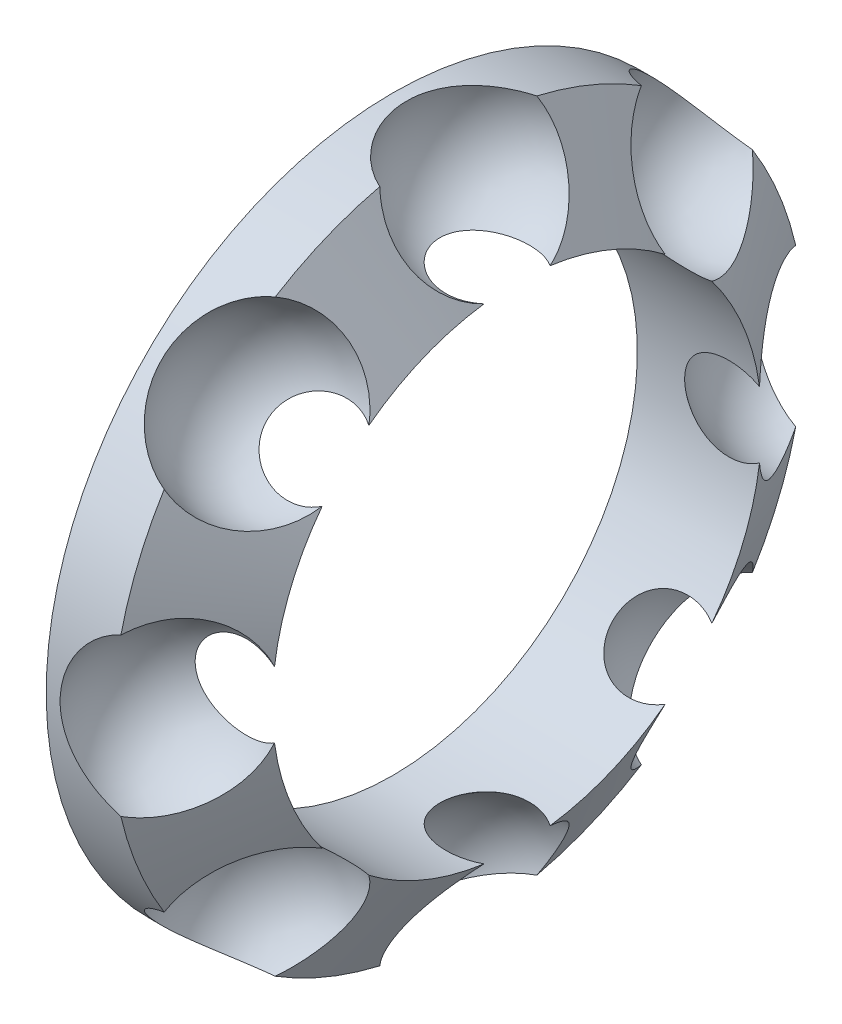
ISO-10303-21;
HEADER;
FILE_DESCRIPTION(('STEP AP214'),'2;1');
FILE_NAME('part.step','',(''),(''),'','','');
FILE_SCHEMA(('AUTOMOTIVE_DESIGN { 1 0 10303 214 1 1 1 1 }'));
ENDSEC;
DATA;
#1=APPLICATION_CONTEXT('core data for automotive mechanical design processes');
#2=APPLICATION_PROTOCOL_DEFINITION('international standard','automotive_design',2000,#1);
#3=PRODUCT_CONTEXT('',#1,'mechanical');
#4=PRODUCT('Part','Part','',(#3));
#5=PRODUCT_RELATED_PRODUCT_CATEGORY('part','',(#4));
#6=PRODUCT_DEFINITION_FORMATION('','',#4);
#7=PRODUCT_DEFINITION_CONTEXT('part definition',#1,'design');
#8=PRODUCT_DEFINITION('design','',#6,#7);
#9=PRODUCT_DEFINITION_SHAPE('','',#8);
#10=(LENGTH_UNIT() NAMED_UNIT(*) SI_UNIT(.MILLI.,.METRE.));
#11=(NAMED_UNIT(*) PLANE_ANGLE_UNIT() SI_UNIT($,.RADIAN.));
#12=(NAMED_UNIT(*) SI_UNIT($,.STERADIAN.) SOLID_ANGLE_UNIT());
#13=UNCERTAINTY_MEASURE_WITH_UNIT(LENGTH_MEASURE(1.E-05),#10,'distance_accuracy_value','');
#14=(GEOMETRIC_REPRESENTATION_CONTEXT(3) GLOBAL_UNCERTAINTY_ASSIGNED_CONTEXT((#13)) GLOBAL_UNIT_ASSIGNED_CONTEXT((#10,
#11,#12)) REPRESENTATION_CONTEXT('',''));
#15=CARTESIAN_POINT('',(0.,0.,0.));
#16=DIRECTION('',(0.,0.,1.));
#17=DIRECTION('',(1.,0.,0.));
#18=AXIS2_PLACEMENT_3D('',#15,#16,#17);
#19=CARTESIAN_POINT('',(1.7,10.266,0.));
#20=DIRECTION('',(-1.,0.,0.));
#21=DIRECTION('',(0.,0.,1.));
#22=AXIS2_PLACEMENT_3D('',#19,#20,#21);
#23=PLANE('',#22);
#24=CARTESIAN_POINT('',(1.7,0.,0.));
#25=DIRECTION('',(-1.,0.,0.));
#26=DIRECTION('',(0.,1.,0.));
#27=AXIS2_PLACEMENT_3D('',#24,#25,#26);
#28=CIRCLE('',#27,8.5);
#29=CARTESIAN_POINT('',(1.7,8.5,0.));
#30=VERTEX_POINT('',#29);
#31=EDGE_CURVE('E164',#30,#30,#28,.T.);
#32=ORIENTED_EDGE('',*,*,#31,.F.);
#33=EDGE_LOOP('',(#32));
#34=FACE_BOUND('',#33,.T.);
#35=CARTESIAN_POINT('',(1.7,0.,0.));
#36=DIRECTION('',(-1.,0.,0.));
#37=DIRECTION('',(0.,1.,0.));
#38=AXIS2_PLACEMENT_3D('',#35,#36,#37);
#39=CIRCLE('',#38,12.032);
#40=CARTESIAN_POINT('',(1.7,12.032,0.));
#41=VERTEX_POINT('',#40);
#42=EDGE_CURVE('E11',#41,#41,#39,.T.);
#43=ORIENTED_EDGE('',*,*,#42,.T.);
#44=EDGE_LOOP('',(#43));
#45=FACE_BOUND('',#44,.T.);
#46=ADVANCED_FACE('F17',(#34,#45),#23,.T.);
#47=DIRECTION('',(0.499999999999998,-0.86602540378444,0.));
#48=VECTOR('',#47,1.);
#49=CARTESIAN_POINT('',(5.,10.266,0.));
#50=LINE('',#49,#48);
#51=CARTESIAN_POINT('',(10.9270778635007,0.,0.));
#52=DIRECTION('',(-1.,0.,0.));
#53=AXIS1_PLACEMENT('',#51,#52);
#54=SURFACE_OF_REVOLUTION('',#50,#53);
#55=CARTESIAN_POINT('',(6.01960057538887,6.76649374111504,-5.14437192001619));
#56=CARTESIAN_POINT('',(6.00166715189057,6.82906288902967,-5.11339916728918));
#57=CARTESIAN_POINT('',(5.98229620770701,6.89224406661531,-5.08458940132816));
#58=CARTESIAN_POINT('',(5.94086436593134,7.0196228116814,-5.03143522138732));
#59=CARTESIAN_POINT('',(5.91880255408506,7.08382071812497,-5.00709233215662));
#60=CARTESIAN_POINT('',(5.84918434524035,7.2767157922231,-4.94129175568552));
#61=CARTESIAN_POINT('',(5.79795455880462,7.40654158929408,-4.90665213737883));
#62=CARTESIAN_POINT('',(5.72577721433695,7.57668809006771,-4.87392984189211));
#63=CARTESIAN_POINT('',(5.70830777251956,7.6169963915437,-4.86710989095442));
#64=CARTESIAN_POINT('',(5.67266069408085,7.69760762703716,-4.85533105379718));
#65=CARTESIAN_POINT('',(5.65448257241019,7.73791053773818,-4.85037346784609));
#66=CARTESIAN_POINT('',(5.57151701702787,7.91843511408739,-4.83238270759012));
#67=CARTESIAN_POINT('',(5.50309461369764,8.05822412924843,-4.82987135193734));
#68=CARTESIAN_POINT('',(5.36081473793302,8.33365739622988,-4.84808123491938));
#69=CARTESIAN_POINT('',(5.28694736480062,8.46929342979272,-4.86884582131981));
#70=CARTESIAN_POINT('',(5.13002383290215,8.74392188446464,-4.93588777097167));
#71=CARTESIAN_POINT('',(5.04670708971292,8.88230258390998,-4.98408789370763));
#72=CARTESIAN_POINT('',(4.87913806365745,9.1466965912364,-5.1059551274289));
#73=CARTESIAN_POINT('',(4.79488584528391,9.27271074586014,-5.17962049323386));
#74=CARTESIAN_POINT('',(4.62751392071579,9.50920571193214,-5.35058761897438));
#75=CARTESIAN_POINT('',(4.54439873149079,9.61963523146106,-5.44796467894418));
#76=CARTESIAN_POINT('',(4.38167538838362,9.82113642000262,-5.66339346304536));
#77=CARTESIAN_POINT('',(4.30206461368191,9.91222275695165,-5.78142939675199));
#78=CARTESIAN_POINT('',(4.18252089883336,10.0365012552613,-5.97805982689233));
#79=CARTESIAN_POINT('',(4.14072022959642,10.0774011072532,-6.05078125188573));
#80=CARTESIAN_POINT('',(4.05906661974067,10.1519556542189,-6.2006877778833));
#81=CARTESIAN_POINT('',(4.01921043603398,10.1856227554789,-6.277864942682));
#82=CARTESIAN_POINT('',(3.98039942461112,10.215539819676,-6.35702526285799));
#83=B_SPLINE_CURVE_WITH_KNOTS('',3,(#55,#56,#57,#58,#59,#60,#61,#62,#63,#64,#65,#66,#67,#68,#69,
#70,#71,#72,#73,#74,#75,#76,#77,#78,#79,#80,#81,#82),.UNSPECIFIED.,.F.,.F.,(4,2,2,2,2,2,2,2,2,2,
2,2,2,4),(0.,0.216116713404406,0.432307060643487,0.861851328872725,0.99519772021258,
1.12863703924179,1.59347517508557,2.05918043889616,2.56244936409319,3.0656838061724,
3.57053767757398,4.07500734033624,4.35460067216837,4.63371052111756),.UNSPECIFIED.);
#84=CARTESIAN_POINT('',(6.01960057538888,6.76649374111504,-5.14437192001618));
#85=VERTEX_POINT('',#84);
#86=CARTESIAN_POINT('',(3.98039942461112,10.215539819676,-6.35702526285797));
#87=VERTEX_POINT('',#86);
#88=EDGE_CURVE('E33',#85,#87,#83,.T.);
#89=ORIENTED_EDGE('',*,*,#88,.T.);
#90=CARTESIAN_POINT('',(3.98039942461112,0.,0.));
#91=DIRECTION('',(-1.,0.,0.));
#92=DIRECTION('',(0.,1.,0.));
#93=AXIS2_PLACEMENT_3D('',#90,#91,#92);
#94=CIRCLE('',#93,12.032);
#95=CARTESIAN_POINT('',(3.98039942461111,11.7185731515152,-2.72838180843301));
#96=VERTEX_POINT('',#95);
#97=EDGE_CURVE('E444',#96,#87,#94,.T.);
#98=ORIENTED_EDGE('',*,*,#97,.F.);
#99=CARTESIAN_POINT('',(3.98039942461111,11.7185731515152,-2.72838180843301));
#100=CARTESIAN_POINT('',(4.0385549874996,11.6029757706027,-2.78061043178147));
#101=CARTESIAN_POINT('',(4.09909518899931,11.4845410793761,-2.82366891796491));
#102=CARTESIAN_POINT('',(4.22418527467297,11.2442122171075,-2.89100780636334));
#103=CARTESIAN_POINT('',(4.28874195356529,11.1223123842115,-2.91525539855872));
#104=CARTESIAN_POINT('',(4.44678684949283,10.8297642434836,-2.95004906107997));
#105=CARTESIAN_POINT('',(4.5417002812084,10.6587293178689,-2.95150432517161));
#106=CARTESIAN_POINT('',(4.73423782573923,10.3221557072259,-2.91681221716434));
#107=CARTESIAN_POINT('',(4.83186164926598,10.1566164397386,-2.88066884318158));
#108=CARTESIAN_POINT('',(5.01317206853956,9.85884698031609,-2.77956733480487));
#109=CARTESIAN_POINT('',(5.09696929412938,9.72512944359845,-2.71913201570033));
#110=CARTESIAN_POINT('',(5.26131549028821,9.4701776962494,-2.57287421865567));
#111=CARTESIAN_POINT('',(5.34186522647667,9.34894053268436,-2.48705776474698));
#112=CARTESIAN_POINT('',(5.4968434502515,9.12205158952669,-2.29234294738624));
#113=CARTESIAN_POINT('',(5.5712702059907,9.01640421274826,-2.18343808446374));
#114=CARTESIAN_POINT('',(5.71085966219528,8.82330145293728,-1.94549569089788));
#115=CARTESIAN_POINT('',(5.77602927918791,8.73583246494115,-1.81647334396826));
#116=CARTESIAN_POINT('',(5.87075875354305,8.61146068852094,-1.59596644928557));
#117=CARTESIAN_POINT('',(5.90424704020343,8.56819584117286,-1.50966028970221));
#118=CARTESIAN_POINT('',(5.96598463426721,8.48939472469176,-1.33196292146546));
#119=CARTESIAN_POINT('',(5.99424107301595,8.45384792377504,-1.24057885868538));
#120=CARTESIAN_POINT('',(6.01960057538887,8.42225387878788,-1.14701333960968));
#121=B_SPLINE_CURVE_WITH_KNOTS('',3,(#99,#100,#101,#102,#103,#104,#105,#106,#107,#108,#109,#110,
#111,#112,#113,#114,#115,#116,#117,#118,#119,#120),.UNSPECIFIED.,.F.,.F.,(4,2,2,2,2,2,2,2,2,2,
4),(0.,0.41812908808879,0.836985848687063,1.41995541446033,2.00286299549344,2.50746954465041,
3.01195642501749,3.51658550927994,4.02083555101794,4.32688871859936,4.63252159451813),.UNSPECIFIED.);
#122=CARTESIAN_POINT('',(6.01960057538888,8.42225387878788,-1.14701333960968));
#123=VERTEX_POINT('',#122);
#124=EDGE_CURVE('E213',#96,#123,#121,.T.);
#125=ORIENTED_EDGE('',*,*,#124,.T.);
#126=CARTESIAN_POINT('',(6.01960057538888,0.,0.));
#127=DIRECTION('',(-1.,0.,0.));
#128=DIRECTION('',(0.,1.,0.));
#129=AXIS2_PLACEMENT_3D('',#126,#127,#128);
#130=CIRCLE('',#129,8.5);
#131=EDGE_CURVE('E244',#123,#85,#130,.T.);
#132=ORIENTED_EDGE('',*,*,#131,.T.);
#133=EDGE_LOOP('',(#89,#98,#125,#132));
#134=FACE_BOUND('',#133,.T.);
#135=ADVANCED_FACE('F218',(#134),#54,.F.);
#136=DIRECTION('',(0.499999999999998,-0.86602540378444,0.));
#137=VECTOR('',#136,1.);
#138=CARTESIAN_POINT('',(5.,10.266,0.));
#139=LINE('',#138,#137);
#140=CARTESIAN_POINT('',(10.9270778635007,0.,0.));
#141=DIRECTION('',(-1.,0.,0.));
#142=AXIS1_PLACEMENT('',#140,#141);
#143=SURFACE_OF_REVOLUTION('',#139,#142);
#144=CARTESIAN_POINT('',(3.98039942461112,0.,0.));
#145=DIRECTION('',(-1.,0.,0.));
#146=DIRECTION('',(0.,1.,0.));
#147=AXIS2_PLACEMENT_3D('',#144,#145,#146);
#148=CIRCLE('',#147,12.032);
#149=CARTESIAN_POINT('',(3.98039942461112,10.215539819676,6.35702526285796));
#150=VERTEX_POINT('',#149);
#151=CARTESIAN_POINT('',(3.98039942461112,11.7185731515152,2.72838180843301));
#152=VERTEX_POINT('',#151);
#153=EDGE_CURVE('E441',#150,#152,#148,.T.);
#154=ORIENTED_EDGE('',*,*,#153,.F.);
#155=CARTESIAN_POINT('',(3.98039942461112,10.215539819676,6.35702526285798));
#156=CARTESIAN_POINT('',(4.01545279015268,10.1885229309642,6.28552356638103));
#157=CARTESIAN_POINT('',(4.05137492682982,10.1584279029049,6.21561667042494));
#158=CARTESIAN_POINT('',(4.12476421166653,10.0923683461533,6.07949067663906));
#159=CARTESIAN_POINT('',(4.16223125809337,10.0564042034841,6.01327133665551));
#160=CARTESIAN_POINT('',(4.2384817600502,9.97893095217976,5.88507759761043));
#161=CARTESIAN_POINT('',(4.27726376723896,9.93742780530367,5.82309874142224));
#162=CARTESIAN_POINT('',(4.35595486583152,9.84920023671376,5.7037778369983));
#163=CARTESIAN_POINT('',(4.39586394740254,9.80247586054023,5.64643574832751));
#164=CARTESIAN_POINT('',(4.51697967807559,9.65495719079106,5.48197690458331));
#165=CARTESIAN_POINT('',(4.59962027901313,9.546770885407,5.38235094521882));
#166=CARTESIAN_POINT('',(4.76653221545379,9.31408912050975,5.20625774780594));
#167=CARTESIAN_POINT('',(4.85080405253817,9.18958857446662,5.12979775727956));
#168=CARTESIAN_POINT('',(5.01890486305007,8.9274661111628,5.00199506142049));
#169=CARTESIAN_POINT('',(5.10273200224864,8.78980933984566,4.95072141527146));
#170=CARTESIAN_POINT('',(5.26697809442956,8.50558976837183,4.8750937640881));
#171=CARTESIAN_POINT('',(5.34740243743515,8.3590420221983,4.85069552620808));
#172=CARTESIAN_POINT('',(5.46151000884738,8.1389631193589,4.83482559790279));
#173=CARTESIAN_POINT('',(5.49764729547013,8.06731464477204,4.83280830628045));
#174=CARTESIAN_POINT('',(5.56819212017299,7.92323505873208,4.83495393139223));
#175=CARTESIAN_POINT('',(5.60259923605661,7.85080376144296,4.83911834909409));
#176=CARTESIAN_POINT('',(5.70053977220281,7.63769403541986,4.8603693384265));
#177=CARTESIAN_POINT('',(5.76125428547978,7.49647320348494,4.88589346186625));
#178=CARTESIAN_POINT('',(5.87240511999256,7.21577055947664,4.95918239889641));
#179=CARTESIAN_POINT('',(5.92284551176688,7.07628807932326,5.00693837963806));
#180=CARTESIAN_POINT('',(5.97630903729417,6.91028279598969,5.07730902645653));
#181=CARTESIAN_POINT('',(5.9853853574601,6.88132843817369,5.09009539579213));
#182=CARTESIAN_POINT('',(6.00294008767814,6.82370524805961,5.1165628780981));
#183=CARTESIAN_POINT('',(6.01141937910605,6.79503605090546,5.13024261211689));
#184=CARTESIAN_POINT('',(6.01960057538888,6.76649374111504,5.14437192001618));
#185=B_SPLINE_CURVE_WITH_KNOTS('',3,(#155,#156,#157,#158,#159,#160,#161,#162,#163,#164,#165,
#166,#167,#168,#169,#170,#171,#172,#173,#174,#175,#176,#177,#178,#179,#180,#181,#182,#183,#184),
.UNSPECIFIED.,.F.,.F.,(4,2,2,2,2,2,2,2,2,2,2,2,2,2,4),(0.,0.252186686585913,0.50435679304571,
0.75625763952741,1.00815628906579,1.51165590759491,2.01531288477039,2.52034325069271,
3.02454116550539,3.26513593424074,3.50578913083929,3.9712645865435,4.43655526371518,
4.53532815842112,4.63395203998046),.UNSPECIFIED.);
#186=CARTESIAN_POINT('',(6.01960057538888,6.76649374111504,5.14437192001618));
#187=VERTEX_POINT('',#186);
#188=EDGE_CURVE('E270',#150,#187,#185,.T.);
#189=ORIENTED_EDGE('',*,*,#188,.T.);
#190=CARTESIAN_POINT('',(6.01960057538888,0.,0.));
#191=DIRECTION('',(-1.,0.,0.));
#192=DIRECTION('',(0.,1.,0.));
#193=AXIS2_PLACEMENT_3D('',#190,#191,#192);
#194=CIRCLE('',#193,8.5);
#195=CARTESIAN_POINT('',(6.01960057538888,8.42225387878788,1.14701333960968));
#196=VERTEX_POINT('',#195);
#197=EDGE_CURVE('E268',#187,#196,#194,.T.);
#198=ORIENTED_EDGE('',*,*,#197,.T.);
#199=CARTESIAN_POINT('',(6.01960057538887,8.42225387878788,1.14701333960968));
#200=CARTESIAN_POINT('',(6.00171687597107,8.4445331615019,1.21298148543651));
#201=CARTESIAN_POINT('',(5.98239667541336,8.46877372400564,1.27787052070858));
#202=CARTESIAN_POINT('',(5.94109030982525,8.52109780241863,1.40518939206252));
#203=CARTESIAN_POINT('',(5.91910464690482,8.5491805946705,1.46761968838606));
#204=CARTESIAN_POINT('',(5.84948158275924,8.6390445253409,1.65072203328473));
#205=CARTESIAN_POINT('',(5.79815240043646,8.70647274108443,1.7672990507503));
#206=CARTESIAN_POINT('',(5.67926102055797,8.86654615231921,2.0035839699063));
#207=CARTESIAN_POINT('',(5.61041811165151,8.96146090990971,2.12111164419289));
#208=CARTESIAN_POINT('',(5.46524928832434,9.16773209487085,2.33532110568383));
#209=CARTESIAN_POINT('',(5.38892108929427,9.27909354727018,2.43199649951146));
#210=CARTESIAN_POINT('',(5.23061988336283,9.51712311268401,2.60307510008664));
#211=CARTESIAN_POINT('',(5.14858582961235,9.64397330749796,2.67716859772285));
#212=CARTESIAN_POINT('',(4.98253761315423,9.90842785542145,2.79933271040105));
#213=CARTESIAN_POINT('',(4.89852376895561,10.046030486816,2.84740748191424));
#214=CARTESIAN_POINT('',(4.73651710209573,10.3188191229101,2.9139473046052));
#215=CARTESIAN_POINT('',(4.65849323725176,10.4535640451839,2.93415892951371));
#216=CARTESIAN_POINT('',(4.50463277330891,10.7256874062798,2.95022835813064));
#217=CARTESIAN_POINT('',(4.42879551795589,10.8630650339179,2.94609354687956));
#218=CARTESIAN_POINT('',(4.28881013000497,11.1221879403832,2.9152656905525));
#219=CARTESIAN_POINT('',(4.22428270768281,11.2440234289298,2.89104997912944));
#220=CARTESIAN_POINT('',(4.13047066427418,11.4242618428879,2.84056421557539));
#221=CARTESIAN_POINT('',(4.09968754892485,11.4839400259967,2.82136723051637));
#222=CARTESIAN_POINT('',(4.03920654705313,11.6021717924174,2.77833329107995));
#223=CARTESIAN_POINT('',(4.00950878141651,11.6607252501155,2.75449582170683));
#224=CARTESIAN_POINT('',(3.98039942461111,11.7185731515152,2.72838180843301));
#225=B_SPLINE_CURVE_WITH_KNOTS('',3,(#199,#200,#201,#202,#203,#204,#205,#206,#207,#208,#209,
#210,#211,#212,#213,#214,#215,#216,#217,#218,#219,#220,#221,#222,#223,#224),.UNSPECIFIED.,.F.,
.F.,(4,2,2,2,2,2,2,2,2,2,2,2,4),(0.,0.215568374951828,0.431096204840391,0.861848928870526,
1.35757703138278,1.85345691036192,2.35585985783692,2.85818252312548,3.32731418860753,
3.79630355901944,4.21478575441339,4.42415482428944,4.6335471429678),.UNSPECIFIED.);
#226=EDGE_CURVE('E261',#196,#152,#225,.T.);
#227=ORIENTED_EDGE('',*,*,#226,.T.);
#228=EDGE_LOOP('',(#154,#189,#198,#227));
#229=FACE_BOUND('',#228,.T.);
#230=ADVANCED_FACE('F280',(#229),#143,.F.);
#231=DIRECTION('',(0.499999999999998,-0.86602540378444,0.));
#232=VECTOR('',#231,1.);
#233=CARTESIAN_POINT('',(5.,10.266,0.));
#234=LINE('',#233,#232);
#235=CARTESIAN_POINT('',(10.9270778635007,0.,0.));
#236=DIRECTION('',(-1.,0.,0.));
#237=AXIS1_PLACEMENT('',#235,#236);
#238=SURFACE_OF_REVOLUTION('',#234,#237);
#239=CARTESIAN_POINT('',(6.01960057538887,1.14701333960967,-8.42225387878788));
#240=CARTESIAN_POINT('',(6.00171709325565,1.21298069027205,-8.44453288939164));
#241=CARTESIAN_POINT('',(5.98239714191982,1.27786895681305,-8.46877313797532));
#242=CARTESIAN_POINT('',(5.94109133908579,1.40518634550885,-8.52109649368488));
#243=CARTESIAN_POINT('',(5.91910599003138,1.46761592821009,-8.54917887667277));
#244=CARTESIAN_POINT('',(5.84948283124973,1.65071920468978,-8.6390428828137));
#245=CARTESIAN_POINT('',(5.79815309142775,1.76729771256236,-8.70647179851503));
#246=CARTESIAN_POINT('',(5.67925933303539,2.00358728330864,-8.86654843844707));
#247=CARTESIAN_POINT('',(5.61041441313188,2.12111781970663,-8.96146606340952));
#248=CARTESIAN_POINT('',(5.46524537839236,2.33532615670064,-9.16773775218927));
#249=CARTESIAN_POINT('',(5.38891936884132,2.43199865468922,-9.27909598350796));
#250=CARTESIAN_POINT('',(5.2306287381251,2.60306523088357,-9.517109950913));
#251=CARTESIAN_POINT('',(5.1486034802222,2.67715176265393,-9.64394652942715));
#252=CARTESIAN_POINT('',(4.98255841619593,2.79932125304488,-9.90839339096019));
#253=CARTESIAN_POINT('',(4.89853846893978,2.84740236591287,-10.0460044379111));
#254=CARTESIAN_POINT('',(4.73059072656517,2.91638047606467,-10.3287993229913));
#255=CARTESIAN_POINT('',(4.64666504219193,2.93715434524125,-10.4740144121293));
#256=CARTESIAN_POINT('',(4.48148253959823,2.95047136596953,-10.7672123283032));
#257=CARTESIAN_POINT('',(4.40022481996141,2.94302415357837,-10.9151941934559));
#258=CARTESIAN_POINT('',(4.26132713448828,2.90524339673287,-11.1739967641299));
#259=CARTESIAN_POINT('',(4.20270705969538,2.88084475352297,-11.2851954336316));
#260=CARTESIAN_POINT('',(4.08885991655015,2.81630444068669,-11.5045814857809));
#261=CARTESIAN_POINT('',(4.03362973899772,2.77617745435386,-11.6127715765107));
#262=CARTESIAN_POINT('',(3.98039942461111,2.728381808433,-11.7185731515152));
#263=B_SPLINE_CURVE_WITH_KNOTS('',3,(#239,#240,#241,#242,#243,#244,#245,#246,#247,#248,#249,
#250,#251,#252,#253,#254,#255,#256,#257,#258,#259,#260,#261,#262),.UNSPECIFIED.,.F.,.F.,(4,2,2,
2,2,2,2,2,2,2,2,4),(0.,0.215565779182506,0.431090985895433,0.861848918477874,1.35758996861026,
1.85345689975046,2.35580188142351,2.85818251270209,3.36282069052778,3.86728657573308,
4.25042861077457,4.63321380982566),.UNSPECIFIED.);
#264=CARTESIAN_POINT('',(6.01960057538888,1.14701333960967,-8.42225387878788));
#265=VERTEX_POINT('',#264);
#266=CARTESIAN_POINT('',(3.98039942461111,2.72838180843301,-11.7185731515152));
#267=VERTEX_POINT('',#266);
#268=EDGE_CURVE('E269',#265,#267,#263,.T.);
#269=ORIENTED_EDGE('',*,*,#268,.T.);
#270=CARTESIAN_POINT('',(3.98039942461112,0.,0.));
#271=DIRECTION('',(-1.,0.,0.));
#272=DIRECTION('',(0.,1.,0.));
#273=AXIS2_PLACEMENT_3D('',#270,#271,#272);
#274=CIRCLE('',#273,12.032);
#275=CARTESIAN_POINT('',(3.98039942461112,6.35702526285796,-10.215539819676));
#276=VERTEX_POINT('',#275);
#277=EDGE_CURVE('E429',#276,#267,#274,.T.);
#278=ORIENTED_EDGE('',*,*,#277,.F.);
#279=CARTESIAN_POINT('',(3.98039942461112,6.35702526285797,-10.215539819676));
#280=CARTESIAN_POINT('',(4.0154483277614,6.2855326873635,-10.1885263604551));
#281=CARTESIAN_POINT('',(4.0513657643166,6.21563451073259,-10.1584355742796));
#282=CARTESIAN_POINT('',(4.12474524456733,6.07952501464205,-10.0923859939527));
#283=CARTESIAN_POINT('',(4.16220718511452,6.01331344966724,-10.0564275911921));
#284=CARTESIAN_POINT('',(4.23845695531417,5.8851176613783,-9.97895722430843));
#285=CARTESIAN_POINT('',(4.27724368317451,5.82313004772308,-9.93744979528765));
#286=CARTESIAN_POINT('',(4.35594453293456,5.70379265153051,-9.84921235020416));
#287=CARTESIAN_POINT('',(4.39585864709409,5.64644283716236,-9.80248236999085));
#288=CARTESIAN_POINT('',(4.51699903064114,5.48195084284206,-9.65493351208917));
#289=CARTESIAN_POINT('',(4.59966046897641,5.38230353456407,-9.54671777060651));
#290=CARTESIAN_POINT('',(4.7665715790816,5.20622123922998,-9.31403132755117));
#291=CARTESIAN_POINT('',(4.85082099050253,5.12978248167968,-9.18956327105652));
#292=CARTESIAN_POINT('',(5.01882694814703,5.00205670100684,-8.92758649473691));
#293=CARTESIAN_POINT('',(5.10258217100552,4.95082030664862,-8.79005218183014));
#294=CARTESIAN_POINT('',(5.26681078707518,4.87514099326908,-8.5058956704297));
#295=CARTESIAN_POINT('',(5.34728327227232,4.85070543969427,-8.35927098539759));
#296=CARTESIAN_POINT('',(5.50200991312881,4.82919958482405,-8.06085195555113));
#297=CARTESIAN_POINT('',(5.57626448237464,4.83212746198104,-7.90905795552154));
#298=CARTESIAN_POINT('',(5.71542720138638,4.86506852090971,-7.60420508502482));
#299=CARTESIAN_POINT('',(5.78034352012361,4.89505786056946,-7.45114744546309));
#300=CARTESIAN_POINT('',(5.87394381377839,4.96348816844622,-7.20911945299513));
#301=CARTESIAN_POINT('',(5.90666357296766,4.9936064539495,-7.11926389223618));
#302=CARTESIAN_POINT('',(5.96704710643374,5.06255687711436,-6.94137012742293));
#303=CARTESIAN_POINT('',(5.99471776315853,5.10137698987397,-6.85332959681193));
#304=CARTESIAN_POINT('',(6.01960057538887,5.14437192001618,-6.76649374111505));
#305=B_SPLINE_CURVE_WITH_KNOTS('',3,(#279,#280,#281,#282,#283,#284,#285,#286,#287,#288,#289,
#290,#291,#292,#293,#294,#295,#296,#297,#298,#299,#300,#301,#302,#303,#304),.UNSPECIFIED.,.F.,
.F.,(4,2,2,2,2,2,2,2,2,2,2,2,4),(0.,0.252154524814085,0.504292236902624,0.75622512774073,
1.00815628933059,1.51177551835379,2.01531288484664,2.51985771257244,3.02454116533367,
3.52919102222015,4.03339669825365,4.33369532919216,4.63358151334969),.UNSPECIFIED.);
#306=CARTESIAN_POINT('',(6.01960057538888,5.14437192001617,-6.76649374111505));
#307=VERTEX_POINT('',#306);
#308=EDGE_CURVE('E437',#276,#307,#305,.T.);
#309=ORIENTED_EDGE('',*,*,#308,.T.);
#310=CARTESIAN_POINT('',(6.01960057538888,0.,0.));
#311=DIRECTION('',(-1.,0.,0.));
#312=DIRECTION('',(0.,1.,0.));
#313=AXIS2_PLACEMENT_3D('',#310,#311,#312);
#314=CIRCLE('',#313,8.5);
#315=EDGE_CURVE('E434',#307,#265,#314,.T.);
#316=ORIENTED_EDGE('',*,*,#315,.T.);
#317=EDGE_LOOP('',(#269,#278,#309,#316));
#318=FACE_BOUND('',#317,.T.);
#319=ADVANCED_FACE('F284',(#318),#238,.F.);
#320=DIRECTION('',(0.499999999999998,-0.86602540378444,0.));
#321=VECTOR('',#320,1.);
#322=CARTESIAN_POINT('',(5.,10.266,0.));
#323=LINE('',#322,#321);
#324=CARTESIAN_POINT('',(10.9270778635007,0.,0.));
#325=DIRECTION('',(-1.,0.,0.));
#326=AXIS1_PLACEMENT('',#324,#325);
#327=SURFACE_OF_REVOLUTION('',#323,#326);
#328=CARTESIAN_POINT('',(6.01960057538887,-5.14437192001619,-6.76649374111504));
#329=CARTESIAN_POINT('',(6.00171709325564,-5.11347959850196,-6.82889334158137));
#330=CARTESIAN_POINT('',(5.98239714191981,-5.08473710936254,-6.89191671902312));
#331=CARTESIAN_POINT('',(5.94109133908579,-5.03170832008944,-7.01894190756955));
#332=CARTESIAN_POINT('',(5.91910599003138,-5.00742118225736,-7.08294353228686));
#333=CARTESIAN_POINT('',(5.84948283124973,-4.94149106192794,-7.27596054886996));
#334=CARTESIAN_POINT('',(5.79815309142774,-4.9067370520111,-7.40607344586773));
#335=CARTESIAN_POINT('',(5.67925933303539,-4.85284637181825,-7.68634668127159));
#336=CARTESIAN_POINT('',(5.61041441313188,-4.83685662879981,-7.83657021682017));
#337=CARTESIAN_POINT('',(5.46524537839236,-4.83124457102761,-8.1338944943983));
#338=CARTESIAN_POINT('',(5.38891936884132,-4.84162895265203,-8.28099443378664));
#339=CARTESIAN_POINT('',(5.2306287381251,-4.88896790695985,-8.57025806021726));
#340=CARTESIAN_POINT('',(5.1486034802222,-4.9262678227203,-8.71233215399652));
#341=CARTESIAN_POINT('',(4.98255841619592,-5.02687311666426,-8.98571119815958));
#342=CARTESIAN_POINT('',(4.89853846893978,-5.0901803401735,-9.11701538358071));
#343=CARTESIAN_POINT('',(4.73059072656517,-5.24137163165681,-9.36575645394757));
#344=CARTESIAN_POINT('',(4.64666504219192,-5.32936486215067,-9.48312837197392));
#345=CARTESIAN_POINT('',(4.48148253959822,-5.52727054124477,-9.69986716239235));
#346=CARTESIAN_POINT('',(4.4002248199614,-5.6371754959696,-9.79924016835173));
#347=CARTESIAN_POINT('',(4.26132713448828,-5.84689157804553,-9.95552619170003));
#348=CARTESIAN_POINT('',(4.20270705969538,-5.94277335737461,-10.0169030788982));
#349=CARTESIAN_POINT('',(4.08885991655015,-6.14353961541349,-10.1263955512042));
#350=CARTESIAN_POINT('',(4.03362973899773,-6.24841562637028,-10.1745234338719));
#351=CARTESIAN_POINT('',(3.98039942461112,-6.35702526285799,-10.215539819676));
#352=B_SPLINE_CURVE_WITH_KNOTS('',3,(#328,#329,#330,#331,#332,#333,#334,#335,#336,#337,#338,
#339,#340,#341,#342,#343,#344,#345,#346,#347,#348,#349,#350,#351),.UNSPECIFIED.,.F.,.F.,(4,2,2,
2,2,2,2,2,2,2,2,4),(0.,0.215565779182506,0.431090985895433,0.861848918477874,1.35758996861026,
1.85345689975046,2.3558018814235,2.85818251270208,3.36282069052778,3.86728657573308,
4.25042861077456,4.63321380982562),.UNSPECIFIED.);
#353=CARTESIAN_POINT('',(6.01960057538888,-5.14437192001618,-6.76649374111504));
#354=VERTEX_POINT('',#353);
#355=CARTESIAN_POINT('',(3.98039942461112,-6.35702526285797,-10.215539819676));
#356=VERTEX_POINT('',#355);
#357=EDGE_CURVE('E309',#354,#356,#352,.T.);
#358=ORIENTED_EDGE('',*,*,#357,.T.);
#359=CARTESIAN_POINT('',(3.98039942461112,0.,0.));
#360=DIRECTION('',(-1.,0.,0.));
#361=DIRECTION('',(0.,1.,0.));
#362=AXIS2_PLACEMENT_3D('',#359,#360,#361);
#363=CIRCLE('',#362,12.032);
#364=CARTESIAN_POINT('',(3.98039942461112,-2.72838180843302,-11.7185731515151));
#365=VERTEX_POINT('',#364);
#366=EDGE_CURVE('E420',#365,#356,#363,.T.);
#367=ORIENTED_EDGE('',*,*,#366,.F.);
#368=CARTESIAN_POINT('',(3.98039942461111,-2.72838180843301,-11.7185731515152));
#369=CARTESIAN_POINT('',(4.01544832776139,-2.75983329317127,-11.6489188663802));
#370=CARTESIAN_POINT('',(4.05136576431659,-2.7879813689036,-11.5782159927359));
#371=CARTESIAN_POINT('',(4.12474524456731,-2.83752121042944,-11.4352679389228));
#372=CARTESIAN_POINT('',(4.1622071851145,-2.85891342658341,-11.3630228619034));
#373=CARTESIAN_POINT('',(4.23845695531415,-2.89478171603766,-11.2175949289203));
#374=CARTESIAN_POINT('',(4.27724368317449,-2.90926339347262,-11.1444128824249));
#375=CARTESIAN_POINT('',(4.35594453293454,-2.93125437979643,-10.9976353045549));
#376=CARTESIAN_POINT('',(4.39585864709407,-2.93876373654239,-10.9240397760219));
#377=CARTESIAN_POINT('',(4.51699903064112,-2.95074434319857,-10.7033935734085));
#378=CARTESIAN_POINT('',(4.59966046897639,-2.94468554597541,-10.5564122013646));
#379=CARTESIAN_POINT('',(4.76657157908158,-2.90466036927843,-10.2673690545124));
#380=CARTESIAN_POINT('',(4.85082099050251,-2.87069852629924,-10.1253064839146));
#381=CARTESIAN_POINT('',(5.01882694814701,-2.77576873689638,-9.84974516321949));
#382=CARTESIAN_POINT('',(5.1025821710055,-2.71474689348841,-9.71626411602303));
#383=CARTESIAN_POINT('',(5.26681078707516,-2.56733125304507,-9.46182176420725));
#384=CARTESIAN_POINT('',(5.3472832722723,-2.48093048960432,-9.3408639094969));
#385=CARTESIAN_POINT('',(5.50200991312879,-2.28512330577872,-9.11464285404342));
#386=CARTESIAN_POINT('',(5.57626448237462,-2.17571841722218,-9.00937860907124));
#387=CARTESIAN_POINT('',(5.71542720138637,-1.93686203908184,-8.81710792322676));
#388=CARTESIAN_POINT('',(5.7803435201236,-1.80742827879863,-8.73008549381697));
#389=CARTESIAN_POINT('',(5.87394381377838,-1.58790110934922,-8.60733339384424));
#390=CARTESIAN_POINT('',(5.90666357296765,-1.50306678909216,-8.56509276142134));
#391=CARTESIAN_POINT('',(5.96704710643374,-1.32852158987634,-8.48805818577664));
#392=CARTESIAN_POINT('',(5.99471776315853,-1.23881756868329,-8.45325409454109));
#393=CARTESIAN_POINT('',(6.01960057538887,-1.14701333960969,-8.42225387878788));
#394=B_SPLINE_CURVE_WITH_KNOTS('',3,(#368,#369,#370,#371,#372,#373,#374,#375,#376,#377,#378,
#379,#380,#381,#382,#383,#384,#385,#386,#387,#388,#389,#390,#391,#392,#393),.UNSPECIFIED.,.F.,
.F.,(4,2,2,2,2,2,2,2,2,2,2,2,4),(0.,0.252154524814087,0.504292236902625,0.75622512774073,
1.00815628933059,1.51177551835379,2.01531288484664,2.51985771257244,3.02454116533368,
3.52919102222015,4.03339669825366,4.33369532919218,4.63358151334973),.UNSPECIFIED.);
#395=CARTESIAN_POINT('',(6.01960057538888,-1.14701333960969,-8.42225387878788));
#396=VERTEX_POINT('',#395);
#397=EDGE_CURVE('E314',#365,#396,#394,.T.);
#398=ORIENTED_EDGE('',*,*,#397,.T.);
#399=CARTESIAN_POINT('',(6.01960057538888,0.,0.));
#400=DIRECTION('',(-1.,0.,0.));
#401=DIRECTION('',(0.,1.,0.));
#402=AXIS2_PLACEMENT_3D('',#399,#400,#401);
#403=CIRCLE('',#402,8.5);
#404=EDGE_CURVE('E321',#396,#354,#403,.T.);
#405=ORIENTED_EDGE('',*,*,#404,.T.);
#406=EDGE_LOOP('',(#358,#367,#398,#405));
#407=FACE_BOUND('',#406,.T.);
#408=ADVANCED_FACE('F299',(#407),#327,.F.);
#409=DIRECTION('',(0.499999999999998,-0.86602540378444,0.));
#410=VECTOR('',#409,1.);
#411=CARTESIAN_POINT('',(5.,10.266,0.));
#412=LINE('',#411,#410);
#413=CARTESIAN_POINT('',(10.9270778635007,0.,0.));
#414=DIRECTION('',(-1.,0.,0.));
#415=AXIS1_PLACEMENT('',#413,#414);
#416=SURFACE_OF_REVOLUTION('',#412,#415);
#417=CARTESIAN_POINT('',(6.01960057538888,0.,0.));
#418=DIRECTION('',(-1.,0.,0.));
#419=DIRECTION('',(0.,1.,0.));
#420=AXIS2_PLACEMENT_3D('',#417,#418,#419);
#421=CIRCLE('',#420,8.5);
#422=CARTESIAN_POINT('',(6.01960057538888,-6.76649374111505,-5.14437192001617));
#423=VERTEX_POINT('',#422);
#424=CARTESIAN_POINT('',(6.01960057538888,-8.42225387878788,-1.14701333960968));
#425=VERTEX_POINT('',#424);
#426=EDGE_CURVE('E410',#423,#425,#421,.T.);
#427=ORIENTED_EDGE('',*,*,#426,.T.);
#428=CARTESIAN_POINT('',(6.01960057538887,-8.42225387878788,-1.14701333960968));
#429=CARTESIAN_POINT('',(6.00171687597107,-8.4445331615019,-1.2129814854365));
#430=CARTESIAN_POINT('',(5.98239667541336,-8.46877372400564,-1.27787052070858));
#431=CARTESIAN_POINT('',(5.94109030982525,-8.52109780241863,-1.40518939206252));
#432=CARTESIAN_POINT('',(5.91910464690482,-8.5491805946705,-1.46761968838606));
#433=CARTESIAN_POINT('',(5.84948158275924,-8.6390445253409,-1.65072203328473));
#434=CARTESIAN_POINT('',(5.79815240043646,-8.70647274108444,-1.7672990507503));
#435=CARTESIAN_POINT('',(5.67926102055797,-8.86654615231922,-2.0035839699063));
#436=CARTESIAN_POINT('',(5.61041811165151,-8.96146090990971,-2.12111164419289));
#437=CARTESIAN_POINT('',(5.46524928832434,-9.16773209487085,-2.33532110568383));
#438=CARTESIAN_POINT('',(5.38892108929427,-9.27909354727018,-2.43199649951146));
#439=CARTESIAN_POINT('',(5.23061988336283,-9.51712311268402,-2.60307510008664));
#440=CARTESIAN_POINT('',(5.14858582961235,-9.64397330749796,-2.67716859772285));
#441=CARTESIAN_POINT('',(4.98253761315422,-9.90842785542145,-2.79933271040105));
#442=CARTESIAN_POINT('',(4.89852376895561,-10.046030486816,-2.84740748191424));
#443=CARTESIAN_POINT('',(4.73651710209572,-10.3188191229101,-2.9139473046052));
#444=CARTESIAN_POINT('',(4.65849323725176,-10.4535640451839,-2.93415892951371));
#445=CARTESIAN_POINT('',(4.50463277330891,-10.7256874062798,-2.95022835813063));
#446=CARTESIAN_POINT('',(4.42879551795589,-10.8630650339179,-2.94609354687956));
#447=CARTESIAN_POINT('',(4.28881013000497,-11.1221879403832,-2.9152656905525));
#448=CARTESIAN_POINT('',(4.22428270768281,-11.2440234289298,-2.89104997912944));
#449=CARTESIAN_POINT('',(4.13047066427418,-11.4242618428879,-2.84056421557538));
#450=CARTESIAN_POINT('',(4.09968754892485,-11.4839400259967,-2.82136723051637));
#451=CARTESIAN_POINT('',(4.03920654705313,-11.6021717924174,-2.77833329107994));
#452=CARTESIAN_POINT('',(4.00950878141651,-11.6607252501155,-2.75449582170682));
#453=CARTESIAN_POINT('',(3.98039942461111,-11.7185731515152,-2.728381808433));
#454=B_SPLINE_CURVE_WITH_KNOTS('',3,(#428,#429,#430,#431,#432,#433,#434,#435,#436,#437,#438,
#439,#440,#441,#442,#443,#444,#445,#446,#447,#448,#449,#450,#451,#452,#453),.UNSPECIFIED.,.F.,
.F.,(4,2,2,2,2,2,2,2,2,2,2,2,4),(0.,0.215568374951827,0.43109620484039,0.861848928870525,
1.35757703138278,1.85345691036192,2.35585985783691,2.85818252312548,3.32731418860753,
3.79630355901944,4.21478575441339,4.42415482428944,4.6335471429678),.UNSPECIFIED.);
#455=CARTESIAN_POINT('',(3.98039942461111,-11.7185731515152,-2.72838180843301));
#456=VERTEX_POINT('',#455);
#457=EDGE_CURVE('E160',#425,#456,#454,.T.);
#458=ORIENTED_EDGE('',*,*,#457,.T.);
#459=CARTESIAN_POINT('',(3.98039942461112,0.,0.));
#460=DIRECTION('',(-1.,0.,0.));
#461=DIRECTION('',(0.,1.,0.));
#462=AXIS2_PLACEMENT_3D('',#459,#460,#461);
#463=CIRCLE('',#462,12.032);
#464=CARTESIAN_POINT('',(3.98039942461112,-10.215539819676,-6.35702526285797));
#465=VERTEX_POINT('',#464);
#466=EDGE_CURVE('E179',#465,#456,#463,.T.);
#467=ORIENTED_EDGE('',*,*,#466,.F.);
#468=CARTESIAN_POINT('',(3.98039942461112,-10.215539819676,-6.35702526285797));
#469=CARTESIAN_POINT('',(4.01545279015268,-10.1885229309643,-6.28552356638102));
#470=CARTESIAN_POINT('',(4.05137492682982,-10.1584279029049,-6.21561667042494));
#471=CARTESIAN_POINT('',(4.12476421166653,-10.0923683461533,-6.07949067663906));
#472=CARTESIAN_POINT('',(4.16223125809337,-10.0564042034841,-6.0132713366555));
#473=CARTESIAN_POINT('',(4.2384817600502,-9.97893095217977,-5.88507759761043));
#474=CARTESIAN_POINT('',(4.27726376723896,-9.93742780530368,-5.82309874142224));
#475=CARTESIAN_POINT('',(4.35595486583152,-9.84920023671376,-5.70377783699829));
#476=CARTESIAN_POINT('',(4.39586394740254,-9.80247586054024,-5.64643574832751));
#477=CARTESIAN_POINT('',(4.51697967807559,-9.65495719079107,-5.4819769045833));
#478=CARTESIAN_POINT('',(4.59962027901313,-9.546770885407,-5.38235094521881));
#479=CARTESIAN_POINT('',(4.76653221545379,-9.31408912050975,-5.20625774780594));
#480=CARTESIAN_POINT('',(4.85080405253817,-9.18958857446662,-5.12979775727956));
#481=CARTESIAN_POINT('',(5.01890486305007,-8.9274661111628,-5.00199506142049));
#482=CARTESIAN_POINT('',(5.10273200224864,-8.78980933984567,-4.95072141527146));
#483=CARTESIAN_POINT('',(5.26697809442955,-8.50558976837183,-4.8750937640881));
#484=CARTESIAN_POINT('',(5.34740243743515,-8.3590420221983,-4.85069552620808));
#485=CARTESIAN_POINT('',(5.46151000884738,-8.13896311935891,-4.83482559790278));
#486=CARTESIAN_POINT('',(5.49764729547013,-8.06731464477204,-4.83280830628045));
#487=CARTESIAN_POINT('',(5.56819212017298,-7.92323505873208,-4.83495393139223));
#488=CARTESIAN_POINT('',(5.60259923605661,-7.85080376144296,-4.83911834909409));
#489=CARTESIAN_POINT('',(5.70053977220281,-7.63769403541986,-4.8603693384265));
#490=CARTESIAN_POINT('',(5.76125428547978,-7.49647320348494,-4.88589346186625));
#491=CARTESIAN_POINT('',(5.87240511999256,-7.21577055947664,-4.95918239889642));
#492=CARTESIAN_POINT('',(5.92284551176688,-7.07628807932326,-5.00693837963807));
#493=CARTESIAN_POINT('',(5.97630903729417,-6.91028279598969,-5.07730902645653));
#494=CARTESIAN_POINT('',(5.9853853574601,-6.88132843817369,-5.09009539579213));
#495=CARTESIAN_POINT('',(6.00294008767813,-6.82370524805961,-5.11656287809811));
#496=CARTESIAN_POINT('',(6.01141937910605,-6.79503605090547,-5.13024261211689));
#497=CARTESIAN_POINT('',(6.01960057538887,-6.76649374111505,-5.14437192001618));
#498=B_SPLINE_CURVE_WITH_KNOTS('',3,(#468,#469,#470,#471,#472,#473,#474,#475,#476,#477,#478,
#479,#480,#481,#482,#483,#484,#485,#486,#487,#488,#489,#490,#491,#492,#493,#494,#495,#496,#497),
.UNSPECIFIED.,.F.,.F.,(4,2,2,2,2,2,2,2,2,2,2,2,2,2,4),(0.,0.252186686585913,0.504356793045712,
0.756257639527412,1.00815628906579,1.51165590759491,2.01531288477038,2.52034325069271,
3.02454116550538,3.26513593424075,3.5057891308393,3.9712645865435,4.43655526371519,
4.53532815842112,4.63395203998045),.UNSPECIFIED.);
#499=EDGE_CURVE('E327',#465,#423,#498,.T.);
#500=ORIENTED_EDGE('',*,*,#499,.T.);
#501=EDGE_LOOP('',(#427,#458,#467,#500));
#502=FACE_BOUND('',#501,.T.);
#503=ADVANCED_FACE('F303',(#502),#416,.F.);
#504=DIRECTION('',(0.499999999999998,-0.86602540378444,0.));
#505=VECTOR('',#504,1.);
#506=CARTESIAN_POINT('',(5.,10.266,0.));
#507=LINE('',#506,#505);
#508=CARTESIAN_POINT('',(10.9270778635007,0.,0.));
#509=DIRECTION('',(-1.,0.,0.));
#510=AXIS1_PLACEMENT('',#508,#509);
#511=SURFACE_OF_REVOLUTION('',#507,#510);
#512=CARTESIAN_POINT('',(6.01960057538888,-6.76649374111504,5.14437192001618));
#513=CARTESIAN_POINT('',(6.00166715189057,-6.82906288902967,5.11339916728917));
#514=CARTESIAN_POINT('',(5.98229620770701,-6.89224406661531,5.08458940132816));
#515=CARTESIAN_POINT('',(5.94086436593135,-7.0196228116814,5.03143522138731));
#516=CARTESIAN_POINT('',(5.91880255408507,-7.08382071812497,5.00709233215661));
#517=CARTESIAN_POINT('',(5.84918434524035,-7.2767157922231,4.94129175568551));
#518=CARTESIAN_POINT('',(5.79795455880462,-7.40654158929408,4.90665213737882));
#519=CARTESIAN_POINT('',(5.72577721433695,-7.57668809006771,4.8739298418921));
#520=CARTESIAN_POINT('',(5.70830777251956,-7.6169963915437,4.86710989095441));
#521=CARTESIAN_POINT('',(5.67266069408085,-7.69760762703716,4.85533105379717));
#522=CARTESIAN_POINT('',(5.65448257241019,-7.73791053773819,4.85037346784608));
#523=CARTESIAN_POINT('',(5.57151701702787,-7.9184351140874,4.83238270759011));
#524=CARTESIAN_POINT('',(5.50309461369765,-8.05822412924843,4.82987135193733));
#525=CARTESIAN_POINT('',(5.36081473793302,-8.33365739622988,4.84808123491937));
#526=CARTESIAN_POINT('',(5.28694736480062,-8.46929342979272,4.8688458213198));
#527=CARTESIAN_POINT('',(5.13002383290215,-8.74392188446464,4.93588777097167));
#528=CARTESIAN_POINT('',(5.04670708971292,-8.88230258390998,4.98408789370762));
#529=CARTESIAN_POINT('',(4.87913806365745,-9.1466965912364,5.10595512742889));
#530=CARTESIAN_POINT('',(4.79488584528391,-9.27271074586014,5.17962049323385));
#531=CARTESIAN_POINT('',(4.62751392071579,-9.50920571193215,5.35058761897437));
#532=CARTESIAN_POINT('',(4.54439873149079,-9.61963523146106,5.44796467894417));
#533=CARTESIAN_POINT('',(4.38167538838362,-9.82113642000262,5.66339346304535));
#534=CARTESIAN_POINT('',(4.30206461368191,-9.91222275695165,5.78142939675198));
#535=CARTESIAN_POINT('',(4.18252089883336,-10.0365012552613,5.97805982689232));
#536=CARTESIAN_POINT('',(4.14072022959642,-10.0774011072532,6.05078125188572));
#537=CARTESIAN_POINT('',(4.05906661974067,-10.1519556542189,6.20068777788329));
#538=CARTESIAN_POINT('',(4.01921043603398,-10.1856227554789,6.27786494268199));
#539=CARTESIAN_POINT('',(3.98039942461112,-10.215539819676,6.35702526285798));
#540=B_SPLINE_CURVE_WITH_KNOTS('',3,(#512,#513,#514,#515,#516,#517,#518,#519,#520,#521,#522,
#523,#524,#525,#526,#527,#528,#529,#530,#531,#532,#533,#534,#535,#536,#537,#538,#539),
.UNSPECIFIED.,.F.,.F.,(4,2,2,2,2,2,2,2,2,2,2,2,2,4),(0.,0.216116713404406,0.432307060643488,
0.861851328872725,0.995197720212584,1.1286370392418,1.59347517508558,2.05918043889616,
2.56244936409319,3.0656838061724,3.57053767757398,4.07500734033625,4.35460067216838,
4.63371052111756),.UNSPECIFIED.);
#541=CARTESIAN_POINT('',(6.01960057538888,-6.76649374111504,5.14437192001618));
#542=VERTEX_POINT('',#541);
#543=CARTESIAN_POINT('',(3.98039942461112,-10.215539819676,6.35702526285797));
#544=VERTEX_POINT('',#543);
#545=EDGE_CURVE('E155',#542,#544,#540,.T.);
#546=ORIENTED_EDGE('',*,*,#545,.T.);
#547=CARTESIAN_POINT('',(3.98039942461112,0.,0.));
#548=DIRECTION('',(-1.,0.,0.));
#549=DIRECTION('',(0.,1.,0.));
#550=AXIS2_PLACEMENT_3D('',#547,#548,#549);
#551=CIRCLE('',#550,12.032);
#552=CARTESIAN_POINT('',(3.98039942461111,-11.7185731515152,2.72838180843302));
#553=VERTEX_POINT('',#552);
#554=EDGE_CURVE('E152',#553,#544,#551,.T.);
#555=ORIENTED_EDGE('',*,*,#554,.F.);
#556=CARTESIAN_POINT('',(3.98039942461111,-11.7185731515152,2.72838180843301));
#557=CARTESIAN_POINT('',(4.0385549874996,-11.6029757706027,2.78061043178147));
#558=CARTESIAN_POINT('',(4.09909518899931,-11.4845410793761,2.82366891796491));
#559=CARTESIAN_POINT('',(4.22418527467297,-11.2442122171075,2.89100780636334));
#560=CARTESIAN_POINT('',(4.28874195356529,-11.1223123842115,2.91525539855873));
#561=CARTESIAN_POINT('',(4.44678684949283,-10.8297642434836,2.95004906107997));
#562=CARTESIAN_POINT('',(4.5417002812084,-10.6587293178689,2.95150432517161));
#563=CARTESIAN_POINT('',(4.73423782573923,-10.3221557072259,2.91681221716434));
#564=CARTESIAN_POINT('',(4.83186164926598,-10.1566164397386,2.88066884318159));
#565=CARTESIAN_POINT('',(5.01317206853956,-9.85884698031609,2.77956733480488));
#566=CARTESIAN_POINT('',(5.09696929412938,-9.72512944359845,2.71913201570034));
#567=CARTESIAN_POINT('',(5.26131549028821,-9.4701776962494,2.57287421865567));
#568=CARTESIAN_POINT('',(5.34186522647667,-9.34894053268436,2.48705776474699));
#569=CARTESIAN_POINT('',(5.4968434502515,-9.12205158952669,2.29234294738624));
#570=CARTESIAN_POINT('',(5.5712702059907,-9.01640421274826,2.18343808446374));
#571=CARTESIAN_POINT('',(5.71085966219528,-8.82330145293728,1.94549569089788));
#572=CARTESIAN_POINT('',(5.77602927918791,-8.73583246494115,1.81647334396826));
#573=CARTESIAN_POINT('',(5.87075875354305,-8.61146068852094,1.59596644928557));
#574=CARTESIAN_POINT('',(5.90424704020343,-8.56819584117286,1.50966028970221));
#575=CARTESIAN_POINT('',(5.96598463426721,-8.48939472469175,1.33196292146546));
#576=CARTESIAN_POINT('',(5.99424107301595,-8.45384792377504,1.24057885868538));
#577=CARTESIAN_POINT('',(6.01960057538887,-8.42225387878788,1.14701333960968));
#578=B_SPLINE_CURVE_WITH_KNOTS('',3,(#556,#557,#558,#559,#560,#561,#562,#563,#564,#565,#566,
#567,#568,#569,#570,#571,#572,#573,#574,#575,#576,#577),.UNSPECIFIED.,.F.,.F.,(4,2,2,2,2,2,2,2,
2,2,4),(0.,0.418129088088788,0.83698584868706,1.41995541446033,2.00286299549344,
2.50746954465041,3.01195642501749,3.51658550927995,4.02083555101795,4.32688871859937,
4.63252159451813),.UNSPECIFIED.);
#579=CARTESIAN_POINT('',(6.01960057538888,-8.42225387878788,1.14701333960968));
#580=VERTEX_POINT('',#579);
#581=EDGE_CURVE('E146',#553,#580,#578,.T.);
#582=ORIENTED_EDGE('',*,*,#581,.T.);
#583=CARTESIAN_POINT('',(6.01960057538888,0.,0.));
#584=DIRECTION('',(-1.,0.,0.));
#585=DIRECTION('',(0.,1.,0.));
#586=AXIS2_PLACEMENT_3D('',#583,#584,#585);
#587=CIRCLE('',#586,8.5);
#588=EDGE_CURVE('E150',#580,#542,#587,.T.);
#589=ORIENTED_EDGE('',*,*,#588,.T.);
#590=EDGE_LOOP('',(#546,#555,#582,#589));
#591=FACE_BOUND('',#590,.T.);
#592=ADVANCED_FACE('F149',(#591),#511,.F.);
#593=DIRECTION('',(0.499999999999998,-0.86602540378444,0.));
#594=VECTOR('',#593,1.);
#595=CARTESIAN_POINT('',(5.,10.266,0.));
#596=LINE('',#595,#594);
#597=CARTESIAN_POINT('',(10.9270778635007,0.,0.));
#598=DIRECTION('',(-1.,0.,0.));
#599=AXIS1_PLACEMENT('',#597,#598);
#600=SURFACE_OF_REVOLUTION('',#596,#599);
#601=CARTESIAN_POINT('',(6.01960057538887,-1.14701333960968,8.42225387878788));
#602=CARTESIAN_POINT('',(6.00171709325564,-1.21298069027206,8.44453288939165));
#603=CARTESIAN_POINT('',(5.98239714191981,-1.27786895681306,8.46877313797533));
#604=CARTESIAN_POINT('',(5.94109133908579,-1.40518634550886,8.52109649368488));
#605=CARTESIAN_POINT('',(5.91910599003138,-1.46761592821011,8.54917887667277));
#606=CARTESIAN_POINT('',(5.84948283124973,-1.65071920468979,8.6390428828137));
#607=CARTESIAN_POINT('',(5.79815309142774,-1.76729771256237,8.70647179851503));
#608=CARTESIAN_POINT('',(5.67925933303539,-2.00358728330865,8.86654843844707));
#609=CARTESIAN_POINT('',(5.61041441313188,-2.12111781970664,8.96146606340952));
#610=CARTESIAN_POINT('',(5.46524537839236,-2.33532615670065,9.16773775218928));
#611=CARTESIAN_POINT('',(5.38891936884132,-2.43199865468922,9.27909598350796));
#612=CARTESIAN_POINT('',(5.2306287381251,-2.60306523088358,9.517109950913));
#613=CARTESIAN_POINT('',(5.1486034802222,-2.67715176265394,9.64394652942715));
#614=CARTESIAN_POINT('',(4.98255841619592,-2.79932125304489,9.90839339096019));
#615=CARTESIAN_POINT('',(4.89853846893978,-2.84740236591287,10.0460044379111));
#616=CARTESIAN_POINT('',(4.73059072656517,-2.91638047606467,10.3287993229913));
#617=CARTESIAN_POINT('',(4.64666504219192,-2.93715434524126,10.4740144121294));
#618=CARTESIAN_POINT('',(4.48148253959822,-2.95047136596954,10.7672123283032));
#619=CARTESIAN_POINT('',(4.4002248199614,-2.94302415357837,10.9151941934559));
#620=CARTESIAN_POINT('',(4.26132713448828,-2.90524339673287,11.1739967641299));
#621=CARTESIAN_POINT('',(4.20270705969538,-2.88084475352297,11.2851954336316));
#622=CARTESIAN_POINT('',(4.08885991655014,-2.81630444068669,11.5045814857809));
#623=CARTESIAN_POINT('',(4.03362973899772,-2.77617745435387,11.6127715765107));
#624=CARTESIAN_POINT('',(3.98039942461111,-2.728381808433,11.7185731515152));
#625=B_SPLINE_CURVE_WITH_KNOTS('',3,(#601,#602,#603,#604,#605,#606,#607,#608,#609,#610,#611,
#612,#613,#614,#615,#616,#617,#618,#619,#620,#621,#622,#623,#624),.UNSPECIFIED.,.F.,.F.,(4,2,2,
2,2,2,2,2,2,2,2,4),(0.,0.215565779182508,0.431090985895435,0.861848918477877,1.35758996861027,
1.85345689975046,2.35580188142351,2.85818251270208,3.36282069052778,3.86728657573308,
4.25042861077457,4.63321380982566),.UNSPECIFIED.);
#626=CARTESIAN_POINT('',(6.01960057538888,-1.14701333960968,8.42225387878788));
#627=VERTEX_POINT('',#626);
#628=CARTESIAN_POINT('',(3.98039942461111,-2.72838180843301,11.7185731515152));
#629=VERTEX_POINT('',#628);
#630=EDGE_CURVE('E167',#627,#629,#625,.T.);
#631=ORIENTED_EDGE('',*,*,#630,.T.);
#632=CARTESIAN_POINT('',(3.98039942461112,0.,0.));
#633=DIRECTION('',(-1.,0.,0.));
#634=DIRECTION('',(0.,1.,0.));
#635=AXIS2_PLACEMENT_3D('',#632,#633,#634);
#636=CIRCLE('',#635,12.032);
#637=CARTESIAN_POINT('',(3.98039942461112,-6.35702526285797,10.215539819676));
#638=VERTEX_POINT('',#637);
#639=EDGE_CURVE('E189',#638,#629,#636,.T.);
#640=ORIENTED_EDGE('',*,*,#639,.F.);
#641=CARTESIAN_POINT('',(3.98039942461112,-6.35702526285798,10.215539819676));
#642=CARTESIAN_POINT('',(4.0154483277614,-6.28553268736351,10.1885263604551));
#643=CARTESIAN_POINT('',(4.0513657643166,-6.2156345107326,10.1584355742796));
#644=CARTESIAN_POINT('',(4.12474524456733,-6.07952501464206,10.0923859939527));
#645=CARTESIAN_POINT('',(4.16220718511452,-6.01331344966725,10.0564275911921));
#646=CARTESIAN_POINT('',(4.23845695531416,-5.88511766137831,9.97895722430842));
#647=CARTESIAN_POINT('',(4.27724368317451,-5.82313004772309,9.93744979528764));
#648=CARTESIAN_POINT('',(4.35594453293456,-5.70379265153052,9.84921235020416));
#649=CARTESIAN_POINT('',(4.39585864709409,-5.64644283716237,9.80248236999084));
#650=CARTESIAN_POINT('',(4.51699903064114,-5.48195084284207,9.65493351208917));
#651=CARTESIAN_POINT('',(4.59966046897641,-5.38230353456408,9.54671777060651));
#652=CARTESIAN_POINT('',(4.7665715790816,-5.20622123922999,9.31403132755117));
#653=CARTESIAN_POINT('',(4.85082099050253,-5.12978248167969,9.18956327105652));
#654=CARTESIAN_POINT('',(5.01882694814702,-5.00205670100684,8.92758649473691));
#655=CARTESIAN_POINT('',(5.10258217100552,-4.95082030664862,8.79005218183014));
#656=CARTESIAN_POINT('',(5.26681078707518,-4.87514099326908,8.5058956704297));
#657=CARTESIAN_POINT('',(5.34728327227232,-4.85070543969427,8.35927098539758));
#658=CARTESIAN_POINT('',(5.50200991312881,-4.82919958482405,8.06085195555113));
#659=CARTESIAN_POINT('',(5.57626448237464,-4.83212746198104,7.90905795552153));
#660=CARTESIAN_POINT('',(5.71542720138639,-4.86506852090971,7.60420508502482));
#661=CARTESIAN_POINT('',(5.78034352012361,-4.89505786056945,7.45114744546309));
#662=CARTESIAN_POINT('',(5.87394381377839,-4.96348816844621,7.20911945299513));
#663=CARTESIAN_POINT('',(5.90666357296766,-4.9936064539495,7.11926389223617));
#664=CARTESIAN_POINT('',(5.96704710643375,-5.06255687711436,6.94137012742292));
#665=CARTESIAN_POINT('',(5.99471776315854,-5.10137698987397,6.85332959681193));
#666=CARTESIAN_POINT('',(6.01960057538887,-5.14437192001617,6.76649374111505));
#667=B_SPLINE_CURVE_WITH_KNOTS('',3,(#641,#642,#643,#644,#645,#646,#647,#648,#649,#650,#651,
#652,#653,#654,#655,#656,#657,#658,#659,#660,#661,#662,#663,#664,#665,#666),.UNSPECIFIED.,.F.,
.F.,(4,2,2,2,2,2,2,2,2,2,2,2,4),(0.,0.252154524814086,0.504292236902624,0.756225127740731,
1.00815628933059,1.51177551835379,2.01531288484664,2.51985771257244,3.02454116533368,
3.52919102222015,4.03339669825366,4.33369532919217,4.63358151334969),.UNSPECIFIED.);
#668=CARTESIAN_POINT('',(6.01960057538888,-5.14437192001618,6.76649374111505));
#669=VERTEX_POINT('',#668);
#670=EDGE_CURVE('E175',#638,#669,#667,.T.);
#671=ORIENTED_EDGE('',*,*,#670,.T.);
#672=CARTESIAN_POINT('',(6.01960057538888,0.,0.));
#673=DIRECTION('',(-1.,0.,0.));
#674=DIRECTION('',(0.,1.,0.));
#675=AXIS2_PLACEMENT_3D('',#672,#673,#674);
#676=CIRCLE('',#675,8.5);
#677=EDGE_CURVE('E185',#669,#627,#676,.T.);
#678=ORIENTED_EDGE('',*,*,#677,.T.);
#679=EDGE_LOOP('',(#631,#640,#671,#678));
#680=FACE_BOUND('',#679,.T.);
#681=ADVANCED_FACE('F392',(#680),#600,.F.);
#682=DIRECTION('',(0.499999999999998,-0.86602540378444,0.));
#683=VECTOR('',#682,1.);
#684=CARTESIAN_POINT('',(5.,10.266,0.));
#685=LINE('',#684,#683);
#686=CARTESIAN_POINT('',(10.9270778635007,0.,0.));
#687=DIRECTION('',(-1.,0.,0.));
#688=AXIS1_PLACEMENT('',#686,#687);
#689=SURFACE_OF_REVOLUTION('',#685,#688);
#690=CARTESIAN_POINT('',(6.01960057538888,5.14437192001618,6.76649374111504));
#691=CARTESIAN_POINT('',(6.00171709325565,5.11347959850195,6.82889334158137));
#692=CARTESIAN_POINT('',(5.98239714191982,5.08473710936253,6.89191671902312));
#693=CARTESIAN_POINT('',(5.94109133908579,5.03170832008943,7.01894190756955));
#694=CARTESIAN_POINT('',(5.91910599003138,5.00742118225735,7.08294353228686));
#695=CARTESIAN_POINT('',(5.84948283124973,4.94149106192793,7.27596054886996));
#696=CARTESIAN_POINT('',(5.79815309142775,4.90673705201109,7.40607344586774));
#697=CARTESIAN_POINT('',(5.67925933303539,4.85284637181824,7.6863466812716));
#698=CARTESIAN_POINT('',(5.61041441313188,4.8368566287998,7.83657021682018));
#699=CARTESIAN_POINT('',(5.46524537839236,4.8312445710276,8.1338944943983));
#700=CARTESIAN_POINT('',(5.38891936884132,4.84162895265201,8.28099443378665));
#701=CARTESIAN_POINT('',(5.2306287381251,4.88896790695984,8.57025806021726));
#702=CARTESIAN_POINT('',(5.1486034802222,4.92626782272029,8.71233215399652));
#703=CARTESIAN_POINT('',(4.98255841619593,5.02687311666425,8.98571119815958));
#704=CARTESIAN_POINT('',(4.89853846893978,5.09018034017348,9.11701538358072));
#705=CARTESIAN_POINT('',(4.73059072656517,5.2413716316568,9.36575645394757));
#706=CARTESIAN_POINT('',(4.64666504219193,5.32936486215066,9.48312837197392));
#707=CARTESIAN_POINT('',(4.48148253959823,5.52727054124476,9.69986716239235));
#708=CARTESIAN_POINT('',(4.40022481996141,5.63717549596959,9.79924016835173));
#709=CARTESIAN_POINT('',(4.26132713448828,5.84689157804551,9.95552619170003));
#710=CARTESIAN_POINT('',(4.20270705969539,5.94277335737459,10.0169030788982));
#711=CARTESIAN_POINT('',(4.08885991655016,6.14353961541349,10.1263955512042));
#712=CARTESIAN_POINT('',(4.03362973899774,6.24841562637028,10.1745234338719));
#713=CARTESIAN_POINT('',(3.98039942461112,6.35702526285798,10.215539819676));
#714=B_SPLINE_CURVE_WITH_KNOTS('',3,(#690,#691,#692,#693,#694,#695,#696,#697,#698,#699,#700,
#701,#702,#703,#704,#705,#706,#707,#708,#709,#710,#711,#712,#713),.UNSPECIFIED.,.F.,.F.,(4,2,2,
2,2,2,2,2,2,2,2,4),(0.,0.215565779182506,0.431090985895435,0.861848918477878,1.35758996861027,
1.85345689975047,2.35580188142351,2.85818251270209,3.36282069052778,3.86728657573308,
4.25042861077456,4.63321380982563),.UNSPECIFIED.);
#715=CARTESIAN_POINT('',(6.01960057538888,5.14437192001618,6.76649374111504));
#716=VERTEX_POINT('',#715);
#717=CARTESIAN_POINT('',(3.98039942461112,6.35702526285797,10.215539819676));
#718=VERTEX_POINT('',#717);
#719=EDGE_CURVE('E188',#716,#718,#714,.T.);
#720=ORIENTED_EDGE('',*,*,#719,.T.);
#721=CARTESIAN_POINT('',(3.98039942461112,0.,0.));
#722=DIRECTION('',(-1.,0.,0.));
#723=DIRECTION('',(0.,1.,0.));
#724=AXIS2_PLACEMENT_3D('',#721,#722,#723);
#725=CIRCLE('',#724,12.032);
#726=CARTESIAN_POINT('',(3.98039942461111,2.72838180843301,11.7185731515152));
#727=VERTEX_POINT('',#726);
#728=EDGE_CURVE('E200',#727,#718,#725,.T.);
#729=ORIENTED_EDGE('',*,*,#728,.F.);
#730=CARTESIAN_POINT('',(3.98039942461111,2.72838180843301,11.7185731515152));
#731=CARTESIAN_POINT('',(4.01544832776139,2.75983329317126,11.6489188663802));
#732=CARTESIAN_POINT('',(4.05136576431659,2.7879813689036,11.5782159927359));
#733=CARTESIAN_POINT('',(4.12474524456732,2.83752121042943,11.4352679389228));
#734=CARTESIAN_POINT('',(4.16220718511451,2.85891342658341,11.3630228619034));
#735=CARTESIAN_POINT('',(4.23845695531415,2.89478171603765,11.2175949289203));
#736=CARTESIAN_POINT('',(4.27724368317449,2.90926339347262,11.1444128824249));
#737=CARTESIAN_POINT('',(4.35594453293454,2.93125437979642,10.9976353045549));
#738=CARTESIAN_POINT('',(4.39585864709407,2.93876373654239,10.9240397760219));
#739=CARTESIAN_POINT('',(4.51699903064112,2.95074434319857,10.7033935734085));
#740=CARTESIAN_POINT('',(4.59966046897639,2.9446855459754,10.5564122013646));
#741=CARTESIAN_POINT('',(4.76657157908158,2.90466036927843,10.2673690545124));
#742=CARTESIAN_POINT('',(4.85082099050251,2.87069852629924,10.1253064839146));
#743=CARTESIAN_POINT('',(5.01882694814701,2.77576873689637,9.84974516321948));
#744=CARTESIAN_POINT('',(5.1025821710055,2.71474689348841,9.71626411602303));
#745=CARTESIAN_POINT('',(5.26681078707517,2.56733125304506,9.46182176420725));
#746=CARTESIAN_POINT('',(5.34728327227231,2.48093048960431,9.3408639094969));
#747=CARTESIAN_POINT('',(5.50200991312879,2.28512330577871,9.11464285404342));
#748=CARTESIAN_POINT('',(5.57626448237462,2.17571841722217,9.00937860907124));
#749=CARTESIAN_POINT('',(5.71542720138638,1.93686203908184,8.81710792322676));
#750=CARTESIAN_POINT('',(5.7803435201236,1.80742827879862,8.73008549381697));
#751=CARTESIAN_POINT('',(5.87394381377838,1.58790110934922,8.60733339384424));
#752=CARTESIAN_POINT('',(5.90666357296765,1.50306678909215,8.56509276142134));
#753=CARTESIAN_POINT('',(5.96704710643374,1.32852158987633,8.48805818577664));
#754=CARTESIAN_POINT('',(5.99471776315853,1.23881756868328,8.45325409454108));
#755=CARTESIAN_POINT('',(6.01960057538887,1.14701333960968,8.42225387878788));
#756=B_SPLINE_CURVE_WITH_KNOTS('',3,(#730,#731,#732,#733,#734,#735,#736,#737,#738,#739,#740,
#741,#742,#743,#744,#745,#746,#747,#748,#749,#750,#751,#752,#753,#754,#755),.UNSPECIFIED.,.F.,
.F.,(4,2,2,2,2,2,2,2,2,2,2,2,4),(0.,0.252154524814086,0.504292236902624,0.756225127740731,
1.00815628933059,1.51177551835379,2.01531288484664,2.51985771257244,3.02454116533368,
3.52919102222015,4.03339669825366,4.33369532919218,4.63358151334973),.UNSPECIFIED.);
#757=CARTESIAN_POINT('',(6.01960057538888,1.14701333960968,8.42225387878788));
#758=VERTEX_POINT('',#757);
#759=EDGE_CURVE('E198',#727,#758,#756,.T.);
#760=ORIENTED_EDGE('',*,*,#759,.T.);
#761=CARTESIAN_POINT('',(6.01960057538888,0.,0.));
#762=DIRECTION('',(-1.,0.,0.));
#763=DIRECTION('',(0.,1.,0.));
#764=AXIS2_PLACEMENT_3D('',#761,#762,#763);
#765=CIRCLE('',#764,8.5);
#766=EDGE_CURVE('E194',#758,#716,#765,.T.);
#767=ORIENTED_EDGE('',*,*,#766,.T.);
#768=EDGE_LOOP('',(#720,#729,#760,#767));
#769=FACE_BOUND('',#768,.T.);
#770=ADVANCED_FACE('F389',(#769),#689,.F.);
#771=CARTESIAN_POINT('',(5.,7.77817459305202,7.77817459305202));
#772=DIRECTION('',(0.916946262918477,0.388862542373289,0.089417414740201));
#773=DIRECTION('',(-0.366053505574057,0.908996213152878,-0.199325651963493));
#774=AXIS2_PLACEMENT_3D('',#771,#772,#773);
#775=SPHERICAL_SURFACE('',#774,3.);
#776=CARTESIAN_POINT('',(2.24916121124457,6.61158696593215,7.50992234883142));
#777=VERTEX_POINT('',#776);
#778=VERTEX_LOOP('',#777);
#779=FACE_BOUND('',#778,.T.);
#780=ORIENTED_EDGE('',*,*,#188,.F.);
#781=CARTESIAN_POINT('',(3.98039942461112,6.35702526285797,10.215539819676));
#782=CARTESIAN_POINT('',(3.90663923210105,6.3826133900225,10.1996132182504));
#783=CARTESIAN_POINT('',(3.834212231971,6.41089036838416,10.1818867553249));
#784=CARTESIAN_POINT('',(3.69251983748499,6.47242521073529,10.14288324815));
#785=CARTESIAN_POINT('',(3.62325365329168,6.50568182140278,10.1216070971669));
#786=CARTESIAN_POINT('',(3.48839944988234,6.57676132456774,10.075565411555));
#787=CARTESIAN_POINT('',(3.42280827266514,6.61458020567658,10.0508029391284));
#788=CARTESIAN_POINT('',(3.29567387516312,6.69435399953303,9.99784704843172));
#789=CARTESIAN_POINT('',(3.23413075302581,6.73630901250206,9.96965354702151));
#790=CARTESIAN_POINT('',(3.05621039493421,6.86766219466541,9.88005266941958));
#791=CARTESIAN_POINT('',(2.94636988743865,6.96264049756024,9.81356647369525));
#792=CARTESIAN_POINT('',(2.74707763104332,7.16333407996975,9.66803865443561));
#793=CARTESIAN_POINT('',(2.65759972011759,7.26903532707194,9.58901336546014));
#794=CARTESIAN_POINT('',(2.53262002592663,7.44290504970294,9.45404356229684));
#795=CARTESIAN_POINT('',(2.48995834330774,7.50887495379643,9.40176595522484));
#796=CARTESIAN_POINT('',(2.41267309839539,7.64246521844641,9.29350047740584));
#797=CARTESIAN_POINT('',(2.37805042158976,7.71008575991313,9.23751219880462));
#798=CARTESIAN_POINT('',(2.29344270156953,7.89906826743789,9.0773750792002));
#799=CARTESIAN_POINT('',(2.25236732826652,8.02143823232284,8.9695501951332));
#800=CARTESIAN_POINT('',(2.19729435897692,8.26495510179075,8.74568303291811));
#801=CARTESIAN_POINT('',(2.1833339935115,8.38610009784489,8.62962968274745));
#802=CARTESIAN_POINT('',(2.18285467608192,8.62335812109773,8.39254488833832));
#803=CARTESIAN_POINT('',(2.19631958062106,8.73947406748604,8.27151641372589));
#804=CARTESIAN_POINT('',(2.25038116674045,8.96360150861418,8.02809128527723));
#805=CARTESIAN_POINT('',(2.29096996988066,9.07161534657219,7.90569503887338));
#806=CARTESIAN_POINT('',(2.39841080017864,9.27707278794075,7.66356119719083));
#807=CARTESIAN_POINT('',(2.46526448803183,9.37451572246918,7.54382377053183));
#808=CARTESIAN_POINT('',(2.62380203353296,9.55690910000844,7.31138576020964));
#809=CARTESIAN_POINT('',(2.7154920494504,9.64185643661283,7.19868693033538));
#810=CARTESIAN_POINT('',(2.92044839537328,9.79698464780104,6.98607794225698));
#811=CARTESIAN_POINT('',(3.03347883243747,9.86731078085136,6.88604626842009));
#812=CARTESIAN_POINT('',(3.27887641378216,9.99329940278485,6.70189909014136));
#813=CARTESIAN_POINT('',(3.41121590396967,10.0489825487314,6.6177612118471));
#814=CARTESIAN_POINT('',(3.61947372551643,10.1204237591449,6.50752676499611));
#815=CARTESIAN_POINT('',(3.68950632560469,10.1420088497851,6.47379824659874));
#816=CARTESIAN_POINT('',(3.83269860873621,10.1815135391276,6.41148536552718));
#817=CARTESIAN_POINT('',(3.90585397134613,10.1994380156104,6.38289416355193));
#818=CARTESIAN_POINT('',(3.98039942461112,10.215539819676,6.35702526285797));
#819=B_SPLINE_CURVE_WITH_KNOTS('',3,(#781,#782,#783,#784,#785,#786,#787,#788,#789,#790,#791,
#792,#793,#794,#795,#796,#797,#798,#799,#800,#801,#802,#803,#804,#805,#806,#807,#808,#809,#810,
#811,#812,#813,#814,#815,#816,#817,#818),.UNSPECIFIED.,.F.,.F.,(4,2,2,2,2,2,2,2,2,2,2,2,2,2,2,2,
2,2,4),(0.,0.238948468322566,0.477836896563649,0.716516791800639,0.955202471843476,
1.43196997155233,1.90812141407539,2.19082229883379,2.47355430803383,2.97555309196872,
3.47824066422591,3.9806324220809,4.48287831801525,4.98515597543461,5.48755828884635,
5.98470178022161,6.48114013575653,6.72289226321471,6.96432012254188),.UNSPECIFIED.);
#820=EDGE_CURVE('E204',#718,#150,#819,.T.);
#821=ORIENTED_EDGE('',*,*,#820,.F.);
#822=ORIENTED_EDGE('',*,*,#719,.F.);
#823=CARTESIAN_POINT('',(6.01960057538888,6.76649374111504,5.14437192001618));
#824=CARTESIAN_POINT('',(5.97745936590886,6.78400928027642,5.12133024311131));
#825=CARTESIAN_POINT('',(5.93400800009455,6.80021534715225,5.09977341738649));
#826=CARTESIAN_POINT('',(5.84488573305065,6.83004844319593,5.0597496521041));
#827=CARTESIAN_POINT('',(5.79921612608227,6.84367695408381,5.04128093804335));
#828=CARTESIAN_POINT('',(5.65972931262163,6.88069783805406,4.99076712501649));
#829=CARTESIAN_POINT('',(5.56313573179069,6.90034664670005,4.96345266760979));
#830=CARTESIAN_POINT('',(5.36598499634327,6.92985520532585,4.92216904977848));
#831=CARTESIAN_POINT('',(5.26543582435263,6.93973371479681,4.90817431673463));
#832=CARTESIAN_POINT('',(5.06281366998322,6.94998590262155,4.8936463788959));
#833=CARTESIAN_POINT('',(4.96073961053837,6.9503525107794,4.89312318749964));
#834=CARTESIAN_POINT('',(4.75456894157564,6.94142395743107,4.90578220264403));
#835=CARTESIAN_POINT('',(4.65051213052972,6.93181925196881,4.91940350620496));
#836=CARTESIAN_POINT('',(4.44673180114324,6.90226725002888,4.9607812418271));
#837=CARTESIAN_POINT('',(4.34700828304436,6.88231995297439,4.98853767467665));
#838=CARTESIAN_POINT('',(4.15685261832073,6.83217427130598,5.05699112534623));
#839=CARTESIAN_POINT('',(4.06628992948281,6.80215854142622,5.09745680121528));
#840=CARTESIAN_POINT('',(3.89609452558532,6.73148767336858,5.19042053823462));
#841=CARTESIAN_POINT('',(3.81645562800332,6.69083859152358,5.24291174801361));
#842=CARTESIAN_POINT('',(3.67910198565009,6.60340868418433,5.35251385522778));
#843=CARTESIAN_POINT('',(3.62000606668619,6.55761352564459,5.40867385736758));
#844=CARTESIAN_POINT('',(3.51700387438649,6.45789108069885,5.52735101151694));
#845=CARTESIAN_POINT('',(3.47307917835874,6.40397377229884,5.58986033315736));
#846=CARTESIAN_POINT('',(3.40786884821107,6.29706691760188,5.70986084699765));
#847=CARTESIAN_POINT('',(3.38432918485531,6.24493259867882,5.76689213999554));
#848=CARTESIAN_POINT('',(3.35194801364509,6.13698584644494,5.88163118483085));
#849=CARTESIAN_POINT('',(3.34309602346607,6.08117606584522,5.93933842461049));
#850=CARTESIAN_POINT('',(3.34070942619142,5.97323047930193,6.0477938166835));
#851=CARTESIAN_POINT('',(3.3457851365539,5.92125672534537,6.09867797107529));
#852=CARTESIAN_POINT('',(3.36808656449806,5.81741752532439,6.19780635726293));
#853=CARTESIAN_POINT('',(3.38531077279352,5.76555206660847,6.24605091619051));
#854=CARTESIAN_POINT('',(3.43088350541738,5.66399161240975,6.33828583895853));
#855=CARTESIAN_POINT('',(3.45912265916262,5.61428045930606,6.38231288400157));
#856=CARTESIAN_POINT('',(3.52556756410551,5.51784926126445,6.46586550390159));
#857=CARTESIAN_POINT('',(3.5637755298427,5.47112988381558,6.50539007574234));
#858=CARTESIAN_POINT('',(3.65176876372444,5.37869663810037,6.5820573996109));
#859=CARTESIAN_POINT('',(3.70217471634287,5.33327905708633,6.61884292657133));
#860=CARTESIAN_POINT('',(3.81112926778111,5.24819899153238,6.68650646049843));
#861=CARTESIAN_POINT('',(3.86968127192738,5.20853892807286,6.71738198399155));
#862=CARTESIAN_POINT('',(4.00042095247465,5.1315327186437,6.77642947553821));
#863=CARTESIAN_POINT('',(4.07340243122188,5.09498104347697,6.80387889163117));
#864=CARTESIAN_POINT('',(4.22534824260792,5.03069070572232,6.85155122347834));
#865=CARTESIAN_POINT('',(4.3043152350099,5.00295598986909,6.87177090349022));
#866=CARTESIAN_POINT('',(4.47599072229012,4.95399503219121,6.90716737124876));
#867=CARTESIAN_POINT('',(4.56921619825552,4.93393606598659,6.92145771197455));
#868=CARTESIAN_POINT('',(4.7583819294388,4.90575670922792,6.94145850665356));
#869=CARTESIAN_POINT('',(4.85432394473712,4.89764424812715,6.94716326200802));
#870=CARTESIAN_POINT('',(5.05435415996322,4.89333532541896,6.95020053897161));
#871=CARTESIAN_POINT('',(5.1584768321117,4.89814988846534,6.94682267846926));
#872=CARTESIAN_POINT('',(5.36424007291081,4.92180346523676,6.93008317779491));
#873=CARTESIAN_POINT('',(5.465882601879,4.94063100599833,6.91672970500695));
#874=CARTESIAN_POINT('',(5.64537138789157,4.98716807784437,6.88322806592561));
#875=CARTESIAN_POINT('',(5.72413712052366,5.01258535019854,6.86479743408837));
#876=CARTESIAN_POINT('',(5.8763363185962,5.07208142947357,6.82094316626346));
#877=CARTESIAN_POINT('',(5.94976492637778,5.10616800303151,6.79551325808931));
#878=CARTESIAN_POINT('',(6.01960057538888,5.14437192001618,6.76649374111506));
#879=B_SPLINE_CURVE_WITH_KNOTS('',3,(#823,#824,#825,#826,#827,#828,#829,#830,#831,#832,#833,
#834,#835,#836,#837,#838,#839,#840,#841,#842,#843,#844,#845,#846,#847,#848,#849,#850,#851,#852,
#853,#854,#855,#856,#857,#858,#859,#860,#861,#862,#863,#864,#865,#866,#867,#868,#869,#870,#871,
#872,#873,#874,#875,#876,#877,#878),.UNSPECIFIED.,.F.,.F.,(4,2,2,2,2,2,2,2,2,2,2,2,2,2,2,2,2,2,
2,2,2,2,2,2,2,2,2,4),(0.,0.153247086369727,0.306405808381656,0.611657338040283,
0.916321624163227,1.22121236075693,1.53585934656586,1.85050634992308,2.1597289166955,
2.46877574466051,2.74765970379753,3.02620380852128,3.26718878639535,3.50800170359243,
3.7256825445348,3.94333634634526,4.15888186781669,4.37447531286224,4.60507370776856,
4.83576879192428,5.09307170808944,5.35048963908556,5.63854061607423,5.92678269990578,
6.23821117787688,6.5493849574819,6.80289898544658,7.05664093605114),.UNSPECIFIED.);
#880=EDGE_CURVE('E505',#187,#716,#879,.T.);
#881=ORIENTED_EDGE('',*,*,#880,.F.);
#882=EDGE_LOOP('',(#780,#821,#822,#881));
#883=FACE_BOUND('',#882,.T.);
#884=ADVANCED_FACE('F357',(#779,#883),#775,.F.);
#885=CARTESIAN_POINT('',(3.85980028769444,0.,0.));
#886=DIRECTION('',(-1.,0.,0.));
#887=DIRECTION('',(0.,0.,1.));
#888=AXIS2_PLACEMENT_3D('',#885,#886,#887);
#889=CYLINDRICAL_SURFACE('',#888,8.5);
#890=CARTESIAN_POINT('',(6.01960057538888,-8.42225387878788,1.14701333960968));
#891=CARTESIAN_POINT('',(5.97745929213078,-8.41834630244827,1.17569167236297));
#892=CARTESIAN_POINT('',(5.93400784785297,-8.41456273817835,1.20239411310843));
#893=CARTESIAN_POINT('',(5.84488541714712,-8.40735683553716,1.25179044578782));
#894=CARTESIAN_POINT('',(5.79921572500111,-8.40393429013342,1.27448664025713));
#895=CARTESIAN_POINT('',(5.65972897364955,-8.3943933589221,1.33638293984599));
#896=CARTESIAN_POINT('',(5.56313555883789,-8.38897293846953,1.36959091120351));
#897=CARTESIAN_POINT('',(5.36598508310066,-8.38064672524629,1.4196484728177));
#898=CARTESIAN_POINT('',(5.26543600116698,-8.37773611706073,1.43652939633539));
#899=CARTESIAN_POINT('',(5.06281384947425,-8.37471270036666,1.45405162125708));
#900=CARTESIAN_POINT('',(4.96073970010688,-8.37460197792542,1.4546808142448));
#901=CARTESIAN_POINT('',(4.75456896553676,-8.37723981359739,1.4394160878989));
#902=CARTESIAN_POINT('',(4.65051217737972,-8.38007997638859,1.4229928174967));
#903=CARTESIAN_POINT('',(4.44673185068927,-8.38844203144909,1.37283794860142));
#904=CARTESIAN_POINT('',(4.34700831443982,-8.39396392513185,1.33910634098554));
#905=CARTESIAN_POINT('',(4.15685146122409,-8.40690955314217,1.25524349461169));
#906=CARTESIAN_POINT('',(4.06628769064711,-8.41429888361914,1.20540480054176));
#907=CARTESIAN_POINT('',(3.89609259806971,-8.43006234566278,1.08969754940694));
#908=CARTESIAN_POINT('',(3.81645482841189,-8.43843589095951,1.02383851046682));
#909=CARTESIAN_POINT('',(3.67910722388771,-8.45411329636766,0.884521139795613));
#910=CARTESIAN_POINT('',(3.62001543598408,-8.46144175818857,0.812433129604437));
#911=CARTESIAN_POINT('',(3.51701138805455,-8.47484495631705,0.6580063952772));
#912=CARTESIAN_POINT('',(3.47308316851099,-8.48092100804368,0.575678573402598));
#913=CARTESIAN_POINT('',(3.40662211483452,-8.49035692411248,0.412146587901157));
#914=CARTESIAN_POINT('',(3.38239807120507,-8.49392656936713,0.331642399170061));
#915=CARTESIAN_POINT('',(3.34993915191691,-8.49874661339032,0.167414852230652));
#916=CARTESIAN_POINT('',(3.34169236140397,-8.4999987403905,0.0836939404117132));
#917=CARTESIAN_POINT('',(3.34168338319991,-8.50000111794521,-0.0742811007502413));
#918=CARTESIAN_POINT('',(3.34817152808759,-8.49901690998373,-0.148540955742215));
#919=CARTESIAN_POINT('',(3.37377809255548,-8.49520159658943,-0.294784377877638));
#920=CARTESIAN_POINT('',(3.39289471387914,-8.49237075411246,-0.36676826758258));
#921=CARTESIAN_POINT('',(3.44277291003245,-8.48519741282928,-0.506260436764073));
#922=CARTESIAN_POINT('',(3.4735047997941,-8.48085876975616,-0.573779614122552));
#923=CARTESIAN_POINT('',(3.54530781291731,-8.47112937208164,-0.702973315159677));
#924=CARTESIAN_POINT('',(3.58638133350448,-8.46573837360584,-0.764646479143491));
#925=CARTESIAN_POINT('',(3.67949918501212,-8.45415719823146,-0.883729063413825));
#926=CARTESIAN_POINT('',(3.7319682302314,-8.44794137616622,-0.940802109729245));
#927=CARTESIAN_POINT('',(3.84489396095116,-8.43550400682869,-1.04647542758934));
#928=CARTESIAN_POINT('',(3.90535665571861,-8.42928245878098,-1.09506926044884));
#929=CARTESIAN_POINT('',(4.00451647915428,-8.41998702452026,-1.16380278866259));
#930=CARTESIAN_POINT('',(4.04108699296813,-8.41673250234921,-1.18705550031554));
#931=CARTESIAN_POINT('',(4.11588657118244,-8.41046628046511,-1.23066680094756));
#932=CARTESIAN_POINT('',(4.15411401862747,-8.40745435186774,-1.25102813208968));
#933=CARTESIAN_POINT('',(4.27099866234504,-8.39888134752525,-1.30777198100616));
#934=CARTESIAN_POINT('',(4.35184397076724,-8.39378442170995,-1.33980462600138));
#935=CARTESIAN_POINT('',(4.52700196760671,-8.38478133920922,-1.39510712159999));
#936=CARTESIAN_POINT('',(4.62178386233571,-8.38108418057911,-1.41691386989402));
#937=CARTESIAN_POINT('',(4.8136807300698,-8.37615900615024,-1.44574237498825));
#938=CARTESIAN_POINT('',(4.91079728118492,-8.37493271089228,-1.45275382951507));
#939=CARTESIAN_POINT('',(5.11225743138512,-8.37507820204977,-1.45192097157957));
#940=CARTESIAN_POINT('',(5.21659758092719,-8.37665143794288,-1.44292477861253));
#941=CARTESIAN_POINT('',(5.42220834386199,-8.38262294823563,-1.40781583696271));
#942=CARTESIAN_POINT('',(5.52348211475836,-8.38701820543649,-1.38172136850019));
#943=CARTESIAN_POINT('',(5.6919546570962,-8.39653889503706,-1.3224072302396));
#944=CARTESIAN_POINT('',(5.76065878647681,-8.40110195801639,-1.29331916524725));
#945=CARTESIAN_POINT('',(5.89370707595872,-8.41110091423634,-1.22656864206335));
#946=CARTESIAN_POINT('',(5.95805032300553,-8.41653698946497,-1.18890439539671));
#947=CARTESIAN_POINT('',(6.01960057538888,-8.42225387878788,-1.14701333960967));
#948=B_SPLINE_CURVE_WITH_KNOTS('',3,(#890,#891,#892,#893,#894,#895,#896,#897,#898,#899,#900,
#901,#902,#903,#904,#905,#906,#907,#908,#909,#910,#911,#912,#913,#914,#915,#916,#917,#918,#919,
#920,#921,#922,#923,#924,#925,#926,#927,#928,#929,#930,#931,#932,#933,#934,#935,#936,#937,#938,
#939,#940,#941,#942,#943,#944,#945,#946,#947),.UNSPECIFIED.,.F.,.F.,(4,2,2,2,2,2,2,2,2,2,2,2,2,
2,2,2,2,2,2,2,2,2,2,2,2,2,2,2,4),(0.,0.153247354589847,0.306406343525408,0.61165733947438,
0.916321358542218,1.22121236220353,1.53585927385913,1.85050635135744,2.15973268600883,
2.46877574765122,2.74763697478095,3.02620380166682,3.27711330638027,3.52783562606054,
3.75035985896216,3.97285241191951,4.19478014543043,4.41675936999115,4.64916592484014,
4.88174819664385,5.01200990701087,5.1421472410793,5.40247314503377,5.69324693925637,
5.98422313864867,6.29699069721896,6.60942441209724,6.83307895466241,7.05678018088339),.UNSPECIFIED.);
#949=EDGE_CURVE('E22',#580,#425,#948,.T.);
#950=ORIENTED_EDGE('',*,*,#949,.T.);
#951=ORIENTED_EDGE('',*,*,#426,.F.);
#952=CARTESIAN_POINT('',(6.01960057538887,-6.76649374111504,-5.14437192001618));
#953=CARTESIAN_POINT('',(5.97745936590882,-6.78400928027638,-5.12133024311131));
#954=CARTESIAN_POINT('',(5.93400800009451,-6.80021534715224,-5.09977341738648));
#955=CARTESIAN_POINT('',(5.84488573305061,-6.83004844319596,-5.05974965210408));
#956=CARTESIAN_POINT('',(5.79921612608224,-6.84367695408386,-5.04128093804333));
#957=CARTESIAN_POINT('',(5.65972931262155,-6.88069783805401,-4.99076712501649));
#958=CARTESIAN_POINT('',(5.56313573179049,-6.90034664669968,-4.96345266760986));
#959=CARTESIAN_POINT('',(5.36598499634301,-6.92985520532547,-4.92216904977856));
#960=CARTESIAN_POINT('',(5.26543582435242,-6.93973371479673,-4.90817431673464));
#961=CARTESIAN_POINT('',(5.06281366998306,-6.94998590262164,-4.89364637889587));
#962=CARTESIAN_POINT('',(4.96073961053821,-6.95035251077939,-4.89312318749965));
#963=CARTESIAN_POINT('',(4.7545689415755,-6.94142395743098,-4.90578220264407));
#964=CARTESIAN_POINT('',(4.6505121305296,-6.93181925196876,-4.91940350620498));
#965=CARTESIAN_POINT('',(4.44673180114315,-6.90226725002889,-4.96078124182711));
#966=CARTESIAN_POINT('',(4.34700828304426,-6.88231995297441,-4.98853767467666));
#967=CARTESIAN_POINT('',(4.15685261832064,-6.83217427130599,-5.05699112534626));
#968=CARTESIAN_POINT('',(4.06628992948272,-6.8021585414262,-5.09745680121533));
#969=CARTESIAN_POINT('',(3.89609452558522,-6.73148767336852,-5.19042053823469));
#970=CARTESIAN_POINT('',(3.81645562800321,-6.69083859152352,-5.24291174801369));
#971=CARTESIAN_POINT('',(3.67910198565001,-6.60340868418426,-5.35251385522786));
#972=CARTESIAN_POINT('',(3.62000606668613,-6.55761352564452,-5.40867385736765));
#973=CARTESIAN_POINT('',(3.51700387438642,-6.45789108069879,-5.52735101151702));
#974=CARTESIAN_POINT('',(3.47307917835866,-6.40397377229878,-5.58986033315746));
#975=CARTESIAN_POINT('',(3.40786884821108,-6.29706691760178,-5.70986084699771));
#976=CARTESIAN_POINT('',(3.38432918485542,-6.24493259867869,-5.76689213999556));
#977=CARTESIAN_POINT('',(3.35194801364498,-6.13698584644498,-5.88163118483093));
#978=CARTESIAN_POINT('',(3.34309602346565,-6.08117606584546,-5.93933842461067));
#979=CARTESIAN_POINT('',(3.34070942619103,-5.97323047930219,-6.04779381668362));
#980=CARTESIAN_POINT('',(3.34578513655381,-5.92125672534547,-6.09867797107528));
#981=CARTESIAN_POINT('',(3.36808656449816,-5.81741752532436,-6.19780635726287));
#982=CARTESIAN_POINT('',(3.3853107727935,-5.76555206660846,-6.24605091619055));
#983=CARTESIAN_POINT('',(3.43088350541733,-5.66399161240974,-6.33828583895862));
#984=CARTESIAN_POINT('',(3.45912265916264,-5.61428045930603,-6.38231288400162));
#985=CARTESIAN_POINT('',(3.52556756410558,-5.5178492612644,-6.46586550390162));
#986=CARTESIAN_POINT('',(3.56377552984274,-5.47112988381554,-6.50539007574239));
#987=CARTESIAN_POINT('',(3.65176876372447,-5.37869663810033,-6.58205739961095));
#988=CARTESIAN_POINT('',(3.70217471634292,-5.3332790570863,-6.61884292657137));
#989=CARTESIAN_POINT('',(3.81112926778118,-5.24819899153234,-6.68650646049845));
#990=CARTESIAN_POINT('',(3.86968127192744,-5.20853892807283,-6.71738198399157));
#991=CARTESIAN_POINT('',(4.00042095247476,-5.13153271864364,-6.77642947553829));
#992=CARTESIAN_POINT('',(4.07340243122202,-5.09498104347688,-6.8038788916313));
#993=CARTESIAN_POINT('',(4.22534824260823,-5.03069070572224,-6.85155122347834));
#994=CARTESIAN_POINT('',(4.30431523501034,-5.00295598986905,-6.87177090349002));
#995=CARTESIAN_POINT('',(4.47599072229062,-4.9539950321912,-6.90716737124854));
#996=CARTESIAN_POINT('',(4.56921619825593,-4.93393606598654,-6.92145771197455));
#997=CARTESIAN_POINT('',(4.75838192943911,-4.90575670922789,-6.94145850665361));
#998=CARTESIAN_POINT('',(4.85432394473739,-4.89764424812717,-6.94716326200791));
#999=CARTESIAN_POINT('',(5.05435415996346,-4.89333532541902,-6.95020053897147));
#1000=CARTESIAN_POINT('',(5.15847683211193,-4.89814988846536,-6.94682267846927));
#1001=CARTESIAN_POINT('',(5.36424007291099,-4.92180346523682,-6.93008317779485));
#1002=CARTESIAN_POINT('',(5.46588260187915,-4.94063100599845,-6.91672970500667));
#1003=CARTESIAN_POINT('',(5.64537138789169,-4.98716807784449,-6.88322806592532));
#1004=CARTESIAN_POINT('',(5.7241371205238,-5.01258535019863,-6.86479743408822));
#1005=CARTESIAN_POINT('',(5.87633631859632,-5.0720814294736,-6.82094316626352));
#1006=CARTESIAN_POINT('',(5.94976492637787,-5.10616800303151,-6.79551325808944));
#1007=CARTESIAN_POINT('',(6.01960057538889,-5.14437192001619,-6.76649374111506));
#1008=B_SPLINE_CURVE_WITH_KNOTS('',3,(#952,#953,#954,#955,#956,#957,#958,#959,#960,#961,#962,
#963,#964,#965,#966,#967,#968,#969,#970,#971,#972,#973,#974,#975,#976,#977,#978,#979,#980,#981,
#982,#983,#984,#985,#986,#987,#988,#989,#990,#991,#992,#993,#994,#995,#996,#997,#998,#999,#1000,
#1001,#1002,#1003,#1004,#1005,#1006,#1007),.UNSPECIFIED.,.F.,.F.,(4,2,2,2,2,2,2,2,2,2,2,2,2,2,2,
2,2,2,2,2,2,2,2,2,2,2,2,4),(0.,0.153247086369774,0.306405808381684,0.611657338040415,
0.916321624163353,1.22121236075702,1.5358593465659,1.85050634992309,2.15972891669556,
2.46877574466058,2.74765970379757,3.02620380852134,3.26718878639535,3.50800170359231,
3.72568254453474,3.94333634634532,4.15888186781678,4.37447531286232,4.60507370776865,
4.83576879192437,5.09307170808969,5.350489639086,5.63854061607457,5.92678269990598,
6.23821117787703,6.54938495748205,6.80289898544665,7.05664093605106),.UNSPECIFIED.);
#1009=EDGE_CURVE('E199',#423,#354,#1008,.T.);
#1010=ORIENTED_EDGE('',*,*,#1009,.T.);
#1011=ORIENTED_EDGE('',*,*,#404,.F.);
#1012=CARTESIAN_POINT('',(6.01960057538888,-1.14701333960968,-8.42225387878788));
#1013=CARTESIAN_POINT('',(5.97745929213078,-1.17569167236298,-8.41834630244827));
#1014=CARTESIAN_POINT('',(5.93400784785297,-1.20239411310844,-8.41456273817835));
#1015=CARTESIAN_POINT('',(5.84488541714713,-1.25179044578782,-8.40735683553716));
#1016=CARTESIAN_POINT('',(5.79921572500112,-1.27448664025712,-8.40393429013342));
#1017=CARTESIAN_POINT('',(5.65972897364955,-1.33638293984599,-8.3943933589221));
#1018=CARTESIAN_POINT('',(5.56313555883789,-1.36959091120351,-8.38897293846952));
#1019=CARTESIAN_POINT('',(5.36598508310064,-1.4196484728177,-8.38064672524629));
#1020=CARTESIAN_POINT('',(5.26543600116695,-1.4365293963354,-8.37773611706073));
#1021=CARTESIAN_POINT('',(5.0628138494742,-1.45405162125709,-8.37471270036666));
#1022=CARTESIAN_POINT('',(4.96073970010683,-1.45468081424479,-8.37460197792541));
#1023=CARTESIAN_POINT('',(4.75456896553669,-1.43941608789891,-8.37723981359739));
#1024=CARTESIAN_POINT('',(4.65051217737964,-1.42299281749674,-8.38007997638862));
#1025=CARTESIAN_POINT('',(4.44673185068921,-1.37283794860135,-8.38844203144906));
#1026=CARTESIAN_POINT('',(4.3470083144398,-1.33910634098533,-8.39396392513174));
#1027=CARTESIAN_POINT('',(4.15685146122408,-1.25524349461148,-8.40690955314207));
#1028=CARTESIAN_POINT('',(4.06628769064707,-1.20540480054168,-8.41429888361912));
#1029=CARTESIAN_POINT('',(3.89609259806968,-1.08969754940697,-8.43006234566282));
#1030=CARTESIAN_POINT('',(3.81645482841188,-1.02383851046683,-8.43843589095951));
#1031=CARTESIAN_POINT('',(3.67910722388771,-0.884521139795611,-8.45411329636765));
#1032=CARTESIAN_POINT('',(3.62001543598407,-0.812433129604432,-8.46144175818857));
#1033=CARTESIAN_POINT('',(3.51701138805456,-0.658006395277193,-8.47484495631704));
#1034=CARTESIAN_POINT('',(3.47308316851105,-0.575678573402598,-8.48092100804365));
#1035=CARTESIAN_POINT('',(3.40662211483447,-0.412146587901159,-8.4903569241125));
#1036=CARTESIAN_POINT('',(3.38239807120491,-0.331642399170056,-8.49392656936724));
#1037=CARTESIAN_POINT('',(3.34993915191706,-0.167414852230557,-8.49874661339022));
#1038=CARTESIAN_POINT('',(3.34169236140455,-0.0836939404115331,-8.49999874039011));
#1039=CARTESIAN_POINT('',(3.34168338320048,0.0742811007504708,-8.50000111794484));
#1040=CARTESIAN_POINT('',(3.34817152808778,0.148540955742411,-8.49901690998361));
#1041=CARTESIAN_POINT('',(3.37377809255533,0.294784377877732,-8.49520159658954));
#1042=CARTESIAN_POINT('',(3.39289471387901,0.366768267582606,-8.49237075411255));
#1043=CARTESIAN_POINT('',(3.44277291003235,0.506260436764,-8.48519741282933));
#1044=CARTESIAN_POINT('',(3.47350479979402,0.573779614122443,-8.48085876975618));
#1045=CARTESIAN_POINT('',(3.54530781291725,0.702973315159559,-8.47112937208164));
#1046=CARTESIAN_POINT('',(3.5863813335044,0.764646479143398,-8.46573837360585));
#1047=CARTESIAN_POINT('',(3.67949918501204,0.883729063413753,-8.45415719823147));
#1048=CARTESIAN_POINT('',(3.73196823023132,0.940802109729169,-8.44794137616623));
#1049=CARTESIAN_POINT('',(3.84489396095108,1.04647542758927,-8.4355040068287));
#1050=CARTESIAN_POINT('',(3.90535665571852,1.09506926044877,-8.42928245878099));
#1051=CARTESIAN_POINT('',(4.00451647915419,1.16380278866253,-8.41998702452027));
#1052=CARTESIAN_POINT('',(4.04108699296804,1.18705550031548,-8.41673250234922));
#1053=CARTESIAN_POINT('',(4.11588657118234,1.2306668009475,-8.41046628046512));
#1054=CARTESIAN_POINT('',(4.15411401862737,1.25102813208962,-8.40745435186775));
#1055=CARTESIAN_POINT('',(4.27099866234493,1.30777198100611,-8.39888134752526));
#1056=CARTESIAN_POINT('',(4.35184397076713,1.33980462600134,-8.39378442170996));
#1057=CARTESIAN_POINT('',(4.52700196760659,1.39510712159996,-8.38478133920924));
#1058=CARTESIAN_POINT('',(4.6217838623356,1.416913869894,-8.38108418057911));
#1059=CARTESIAN_POINT('',(4.81368073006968,1.44574237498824,-8.37615900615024));
#1060=CARTESIAN_POINT('',(4.9107972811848,1.45275382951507,-8.37493271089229));
#1061=CARTESIAN_POINT('',(5.11225743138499,1.45192097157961,-8.37507820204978));
#1062=CARTESIAN_POINT('',(5.21659758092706,1.44292477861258,-8.3766514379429));
#1063=CARTESIAN_POINT('',(5.42220834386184,1.4078158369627,-8.3826229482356));
#1064=CARTESIAN_POINT('',(5.5234821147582,1.38172136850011,-8.38701820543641));
#1065=CARTESIAN_POINT('',(5.69195465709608,1.32240723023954,-8.396538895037));
#1066=CARTESIAN_POINT('',(5.76065878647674,1.29331916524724,-8.40110195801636));
#1067=CARTESIAN_POINT('',(5.89370707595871,1.2265686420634,-8.41110091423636));
#1068=CARTESIAN_POINT('',(5.95805032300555,1.18890439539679,-8.41653698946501));
#1069=CARTESIAN_POINT('',(6.01960057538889,1.14701333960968,-8.42225387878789));
#1070=B_SPLINE_CURVE_WITH_KNOTS('',3,(#1012,#1013,#1014,#1015,#1016,#1017,#1018,#1019,#1020,
#1021,#1022,#1023,#1024,#1025,#1026,#1027,#1028,#1029,#1030,#1031,#1032,#1033,#1034,#1035,#1036,
#1037,#1038,#1039,#1040,#1041,#1042,#1043,#1044,#1045,#1046,#1047,#1048,#1049,#1050,#1051,#1052,
#1053,#1054,#1055,#1056,#1057,#1058,#1059,#1060,#1061,#1062,#1063,#1064,#1065,#1066,#1067,#1068,
#1069),.UNSPECIFIED.,.F.,.F.,(4,2,2,2,2,2,2,2,2,2,2,2,2,2,2,2,2,2,2,2,2,2,2,2,2,2,2,2,4),(0.,
0.153247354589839,0.306406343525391,0.61165733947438,0.916321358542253,1.22121236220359,
1.53585927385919,1.85050635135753,2.15973268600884,2.46877574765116,2.74763697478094,
3.02620380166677,3.27711330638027,3.52783562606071,3.75035985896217,3.97285241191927,
4.19478014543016,4.4167593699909,4.6491659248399,4.88174819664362,5.01200990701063,
5.14214724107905,5.40247314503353,5.69324693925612,5.98422313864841,6.29699069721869,
6.60942441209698,6.83307895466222,7.05678018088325),.UNSPECIFIED.);
#1071=EDGE_CURVE('E564',#396,#265,#1070,.T.);
#1072=ORIENTED_EDGE('',*,*,#1071,.T.);
#1073=ORIENTED_EDGE('',*,*,#315,.F.);
#1074=CARTESIAN_POINT('',(6.01960057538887,5.14437192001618,-6.76649374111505));
#1075=CARTESIAN_POINT('',(5.97745936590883,5.12133024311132,-6.78400928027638));
#1076=CARTESIAN_POINT('',(5.93400800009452,5.09977341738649,-6.80021534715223));
#1077=CARTESIAN_POINT('',(5.84488573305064,5.05974965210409,-6.83004844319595));
#1078=CARTESIAN_POINT('',(5.79921612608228,5.04128093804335,-6.84367695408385));
#1079=CARTESIAN_POINT('',(5.65972931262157,4.9907671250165,-6.880697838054));
#1080=CARTESIAN_POINT('',(5.56313573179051,4.96345266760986,-6.90034664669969));
#1081=CARTESIAN_POINT('',(5.365984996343,4.92216904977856,-6.92985520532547));
#1082=CARTESIAN_POINT('',(5.26543582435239,4.90817431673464,-6.93973371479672));
#1083=CARTESIAN_POINT('',(5.06281366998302,4.89364637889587,-6.94998590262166));
#1084=CARTESIAN_POINT('',(4.96073961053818,4.89312318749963,-6.95035251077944));
#1085=CARTESIAN_POINT('',(4.75456894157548,4.90578220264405,-6.94142395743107));
#1086=CARTESIAN_POINT('',(4.65051213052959,4.91940350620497,-6.93181925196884));
#1087=CARTESIAN_POINT('',(4.44673180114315,4.96078124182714,-6.9022672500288));
#1088=CARTESIAN_POINT('',(4.34700828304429,4.98853767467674,-6.88231995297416));
#1089=CARTESIAN_POINT('',(4.15685261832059,5.05699112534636,-6.83217427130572));
#1090=CARTESIAN_POINT('',(4.06628992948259,5.09745680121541,-6.80215854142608));
#1091=CARTESIAN_POINT('',(3.89609452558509,5.19042053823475,-6.73148767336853));
#1092=CARTESIAN_POINT('',(3.81645562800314,5.24291174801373,-6.69083859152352));
#1093=CARTESIAN_POINT('',(3.67910198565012,5.35251385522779,-6.60340868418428));
#1094=CARTESIAN_POINT('',(3.62000606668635,5.40867385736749,-6.55761352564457));
#1095=CARTESIAN_POINT('',(3.51700387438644,5.52735101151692,-6.45789108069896));
#1096=CARTESIAN_POINT('',(3.47307917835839,5.58986033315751,-6.40397377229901));
#1097=CARTESIAN_POINT('',(3.40786884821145,5.70986084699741,-6.29706691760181));
#1098=CARTESIAN_POINT('',(3.38432918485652,5.76689213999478,-6.24493259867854));
#1099=CARTESIAN_POINT('',(3.35194801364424,5.88163118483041,-6.13698584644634));
#1100=CARTESIAN_POINT('',(3.34309602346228,5.9393384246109,-6.08117606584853));
#1101=CARTESIAN_POINT('',(3.34070942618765,6.04779381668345,-5.97323047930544));
#1102=CARTESIAN_POINT('',(3.34578513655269,6.09867797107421,-5.92125672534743));
#1103=CARTESIAN_POINT('',(3.36808656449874,6.19780635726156,-5.8174175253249));
#1104=CARTESIAN_POINT('',(3.38531077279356,6.2460509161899,-5.76555206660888));
#1105=CARTESIAN_POINT('',(3.43088350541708,6.33828583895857,-5.66399161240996));
#1106=CARTESIAN_POINT('',(3.45912265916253,6.38231288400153,-5.61428045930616));
#1107=CARTESIAN_POINT('',(3.5255675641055,6.46586550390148,-5.51784926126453));
#1108=CARTESIAN_POINT('',(3.56377552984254,6.50539007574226,-5.47112988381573));
#1109=CARTESIAN_POINT('',(3.65176876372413,6.5820573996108,-5.3786966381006));
#1110=CARTESIAN_POINT('',(3.70217471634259,6.61884292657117,-5.33327905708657));
#1111=CARTESIAN_POINT('',(3.81112926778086,6.68650646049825,-5.24819899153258));
#1112=CARTESIAN_POINT('',(3.86968127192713,6.71738198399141,-5.20853892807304));
#1113=CARTESIAN_POINT('',(4.00042095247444,6.77642947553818,-5.13153271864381));
#1114=CARTESIAN_POINT('',(4.07340243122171,6.8038788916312,-5.09498104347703));
#1115=CARTESIAN_POINT('',(4.22534824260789,6.85155122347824,-5.03069070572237));
#1116=CARTESIAN_POINT('',(4.30431523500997,6.87177090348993,-5.00295598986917));
#1117=CARTESIAN_POINT('',(4.4759907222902,6.90716737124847,-4.9539950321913));
#1118=CARTESIAN_POINT('',(4.56921619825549,6.92145771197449,-4.93393606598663));
#1119=CARTESIAN_POINT('',(4.75838192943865,6.94145850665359,-4.90575670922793));
#1120=CARTESIAN_POINT('',(4.85432394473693,6.94716326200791,-4.8976442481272));
#1121=CARTESIAN_POINT('',(5.05435415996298,6.95020053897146,-4.89333532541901));
#1122=CARTESIAN_POINT('',(5.15847683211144,6.94682267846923,-4.89814988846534));
#1123=CARTESIAN_POINT('',(5.36424007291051,6.93008317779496,-4.92180346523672));
#1124=CARTESIAN_POINT('',(5.46588260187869,6.91672970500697,-4.94063100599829));
#1125=CARTESIAN_POINT('',(5.6453713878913,6.88322806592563,-4.9871680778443));
#1126=CARTESIAN_POINT('',(5.72413712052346,6.8647974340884,-5.01258535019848));
#1127=CARTESIAN_POINT('',(5.87633631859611,6.8209431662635,-5.07208142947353));
#1128=CARTESIAN_POINT('',(5.94976492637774,6.79551325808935,-5.10616800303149));
#1129=CARTESIAN_POINT('',(6.01960057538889,6.76649374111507,-5.14437192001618));
#1130=B_SPLINE_CURVE_WITH_KNOTS('',3,(#1074,#1075,#1076,#1077,#1078,#1079,#1080,#1081,#1082,
#1083,#1084,#1085,#1086,#1087,#1088,#1089,#1090,#1091,#1092,#1093,#1094,#1095,#1096,#1097,#1098,
#1099,#1100,#1101,#1102,#1103,#1104,#1105,#1106,#1107,#1108,#1109,#1110,#1111,#1112,#1113,#1114,
#1115,#1116,#1117,#1118,#1119,#1120,#1121,#1122,#1123,#1124,#1125,#1126,#1127,#1128,#1129),
.UNSPECIFIED.,.F.,.F.,(4,2,2,2,2,2,2,2,2,2,2,2,2,2,2,2,2,2,2,2,2,2,2,2,2,2,2,4),(0.,
0.15324708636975,0.30640580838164,0.611657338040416,0.916321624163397,1.22121236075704,
1.53585934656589,1.85050634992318,2.15972891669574,2.46877574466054,2.74765970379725,
3.0262038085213,3.26718878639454,3.50800170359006,3.72568254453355,3.94333634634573,
4.15888186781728,4.37447531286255,4.6050737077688,4.83576879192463,5.09307170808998,
5.35048963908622,5.63854061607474,5.92678269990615,6.23821117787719,6.54938495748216,
6.80289898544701,7.05664093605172),.UNSPECIFIED.);
#1131=EDGE_CURVE('E454',#307,#85,#1130,.T.);
#1132=ORIENTED_EDGE('',*,*,#1131,.T.);
#1133=ORIENTED_EDGE('',*,*,#131,.F.);
#1134=CARTESIAN_POINT('',(6.01960057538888,8.42225387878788,-1.14701333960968));
#1135=CARTESIAN_POINT('',(5.97745929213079,8.41834630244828,-1.17569167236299));
#1136=CARTESIAN_POINT('',(5.93400784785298,8.41456273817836,-1.20239411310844));
#1137=CARTESIAN_POINT('',(5.84488541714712,8.40735683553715,-1.25179044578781));
#1138=CARTESIAN_POINT('',(5.79921572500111,8.40393429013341,-1.2744866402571));
#1139=CARTESIAN_POINT('',(5.65972897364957,8.39439335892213,-1.33638293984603));
#1140=CARTESIAN_POINT('',(5.56313555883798,8.38897293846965,-1.3695909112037));
#1141=CARTESIAN_POINT('',(5.36598508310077,8.38064672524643,-1.41964847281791));
#1142=CARTESIAN_POINT('',(5.26543600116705,8.37773611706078,-1.43652939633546));
#1143=CARTESIAN_POINT('',(5.06281384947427,8.37471270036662,-1.45405162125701));
#1144=CARTESIAN_POINT('',(4.96073970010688,8.37460197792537,-1.45468081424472));
#1145=CARTESIAN_POINT('',(4.75456896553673,8.37723981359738,-1.43941608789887));
#1146=CARTESIAN_POINT('',(4.65051217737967,8.38007997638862,-1.42299281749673));
#1147=CARTESIAN_POINT('',(4.44673185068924,8.38844203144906,-1.37283794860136));
#1148=CARTESIAN_POINT('',(4.34700831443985,8.39396392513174,-1.33910634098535));
#1149=CARTESIAN_POINT('',(4.15685146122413,8.40690955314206,-1.25524349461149));
#1150=CARTESIAN_POINT('',(4.06628769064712,8.41429888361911,-1.2054048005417));
#1151=CARTESIAN_POINT('',(3.89609259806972,8.43006234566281,-1.089697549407));
#1152=CARTESIAN_POINT('',(3.81645482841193,8.43843589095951,-1.02383851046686));
#1153=CARTESIAN_POINT('',(3.67910722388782,8.45411329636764,-0.884521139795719));
#1154=CARTESIAN_POINT('',(3.62001543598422,8.46144175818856,-0.812433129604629));
#1155=CARTESIAN_POINT('',(3.51701138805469,8.47484495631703,-0.65800639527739));
#1156=CARTESIAN_POINT('',(3.47308316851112,8.48092100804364,-0.575678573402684));
#1157=CARTESIAN_POINT('',(3.40662211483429,8.49035692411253,-0.412146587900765));
#1158=CARTESIAN_POINT('',(3.38239807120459,8.49392656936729,-0.331642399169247));
#1159=CARTESIAN_POINT('',(3.349939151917,8.49874661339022,-0.1674148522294));
#1160=CARTESIAN_POINT('',(3.34169236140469,8.49999874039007,-0.0836939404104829));
#1161=CARTESIAN_POINT('',(3.34168338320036,8.50000111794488,0.0742811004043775));
#1162=CARTESIAN_POINT('',(3.34817152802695,8.49901690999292,0.148540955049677));
#1163=CARTESIAN_POINT('',(3.37377809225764,8.49520159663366,0.294784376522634));
#1164=CARTESIAN_POINT('',(3.39289471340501,8.49237075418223,0.366768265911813));
#1165=CARTESIAN_POINT('',(3.44277290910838,8.48519741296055,0.506260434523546));
#1166=CARTESIAN_POINT('',(3.47350479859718,8.48085876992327,0.573779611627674));
#1167=CARTESIAN_POINT('',(3.54530781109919,8.47112937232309,0.702973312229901));
#1168=CARTESIAN_POINT('',(3.58638133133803,8.46573837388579,0.764646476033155));
#1169=CARTESIAN_POINT('',(3.67949918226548,8.45415719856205,0.883729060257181));
#1170=CARTESIAN_POINT('',(3.73196822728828,8.44794137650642,0.940802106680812));
#1171=CARTESIAN_POINT('',(3.84489395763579,8.4355040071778,1.04647542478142));
#1172=CARTESIAN_POINT('',(3.90535665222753,8.42928245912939,1.09506925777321));
#1173=CARTESIAN_POINT('',(4.00451647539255,8.41998702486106,1.16380278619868));
#1174=CARTESIAN_POINT('',(4.04108698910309,8.41673250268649,1.1870554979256));
#1175=CARTESIAN_POINT('',(4.11588656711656,8.41046628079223,1.23066679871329));
#1176=CARTESIAN_POINT('',(4.15411401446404,8.40745435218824,1.2510281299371));
#1177=CARTESIAN_POINT('',(4.27099865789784,8.39888134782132,1.30777197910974));
#1178=CARTESIAN_POINT('',(4.35184396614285,8.39378442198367,1.33980462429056));
#1179=CARTESIAN_POINT('',(4.52700196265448,8.38478133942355,1.39510712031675));
#1180=CARTESIAN_POINT('',(4.62178385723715,8.38108418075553,1.41691386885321));
#1181=CARTESIAN_POINT('',(4.81368072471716,8.376159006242,1.4457423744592));
#1182=CARTESIAN_POINT('',(4.91079727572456,8.3749327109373,1.45275382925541));
#1183=CARTESIAN_POINT('',(5.11225742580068,8.37507820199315,1.45192097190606));
#1184=CARTESIAN_POINT('',(5.21659757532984,8.37665143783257,1.44292477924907));
#1185=CARTESIAN_POINT('',(5.42220833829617,8.3826229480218,1.40781583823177));
#1186=CARTESIAN_POINT('',(5.52348210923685,8.38701820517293,1.38172137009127));
#1187=CARTESIAN_POINT('',(5.6919546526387,8.39653889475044,1.32240723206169));
#1188=CARTESIAN_POINT('',(5.76065878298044,8.4011019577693,1.29331916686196));
#1189=CARTESIAN_POINT('',(5.8937070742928,8.41110091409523,1.22656864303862));
#1190=CARTESIAN_POINT('',(5.95805032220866,8.41653698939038,1.18890439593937));
#1191=CARTESIAN_POINT('',(6.01960057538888,8.42225387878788,1.14701333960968));
#1192=B_SPLINE_CURVE_WITH_KNOTS('',3,(#1134,#1135,#1136,#1137,#1138,#1139,#1140,#1141,#1142,
#1143,#1144,#1145,#1146,#1147,#1148,#1149,#1150,#1151,#1152,#1153,#1154,#1155,#1156,#1157,#1158,
#1159,#1160,#1161,#1162,#1163,#1164,#1165,#1166,#1167,#1168,#1169,#1170,#1171,#1172,#1173,#1174,
#1175,#1176,#1177,#1178,#1179,#1180,#1181,#1182,#1183,#1184,#1185,#1186,#1187,#1188,#1189,#1190,
#1191),.UNSPECIFIED.,.F.,.F.,(4,2,2,2,2,2,2,2,2,2,2,2,2,2,2,2,2,2,2,2,2,2,2,2,2,2,2,2,4),(0.,
0.153247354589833,0.306406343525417,0.611657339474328,0.916321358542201,1.22121236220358,
1.5358592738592,1.85050635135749,2.15973268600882,2.46877574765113,2.74763697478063,
3.02620380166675,3.2771133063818,3.52783562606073,3.75035985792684,3.97285240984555,
4.1947801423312,4.41675936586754,4.64916592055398,4.8817481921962,5.01200990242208,
5.14214723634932,5.40247314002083,5.69324693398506,5.98422313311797,6.2969906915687,
6.60942440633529,6.83307895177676,7.05678018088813),.UNSPECIFIED.);
#1193=EDGE_CURVE('E447',#123,#196,#1192,.T.);
#1194=ORIENTED_EDGE('',*,*,#1193,.T.);
#1195=ORIENTED_EDGE('',*,*,#197,.F.);
#1196=ORIENTED_EDGE('',*,*,#880,.T.);
#1197=ORIENTED_EDGE('',*,*,#766,.F.);
#1198=CARTESIAN_POINT('',(6.01960057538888,1.14701333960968,8.42225387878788));
#1199=CARTESIAN_POINT('',(5.97745929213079,1.17569167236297,8.41834630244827));
#1200=CARTESIAN_POINT('',(5.93400784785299,1.20239411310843,8.41456273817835));
#1201=CARTESIAN_POINT('',(5.84488541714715,1.25179044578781,8.40735683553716));
#1202=CARTESIAN_POINT('',(5.79921572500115,1.27448664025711,8.40393429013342));
#1203=CARTESIAN_POINT('',(5.65972897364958,1.33638293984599,8.39439335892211));
#1204=CARTESIAN_POINT('',(5.56313555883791,1.36959091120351,8.38897293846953));
#1205=CARTESIAN_POINT('',(5.36598508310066,1.41964847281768,8.38064672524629));
#1206=CARTESIAN_POINT('',(5.26543600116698,1.43652939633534,8.37773611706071));
#1207=CARTESIAN_POINT('',(5.06281384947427,1.45405162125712,8.37471270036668));
#1208=CARTESIAN_POINT('',(4.96073970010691,1.45468081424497,8.3746019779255));
#1209=CARTESIAN_POINT('',(4.75456896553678,1.4394160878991,8.37723981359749));
#1210=CARTESIAN_POINT('',(4.65051217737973,1.4229928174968,8.38007997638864));
#1211=CARTESIAN_POINT('',(4.44673185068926,1.37283794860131,8.38844203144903));
#1212=CARTESIAN_POINT('',(4.34700831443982,1.33910634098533,8.39396392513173));
#1213=CARTESIAN_POINT('',(4.15685146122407,1.25524349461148,8.40690955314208));
#1214=CARTESIAN_POINT('',(4.06628769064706,1.20540480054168,8.41429888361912));
#1215=CARTESIAN_POINT('',(3.89609259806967,1.08969754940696,8.43006234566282));
#1216=CARTESIAN_POINT('',(3.81645482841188,1.02383851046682,8.43843589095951));
#1217=CARTESIAN_POINT('',(3.6791072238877,0.884521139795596,8.45411329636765));
#1218=CARTESIAN_POINT('',(3.62001543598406,0.812433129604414,8.46144175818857));
#1219=CARTESIAN_POINT('',(3.51701138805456,0.658006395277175,8.47484495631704));
#1220=CARTESIAN_POINT('',(3.47308316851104,0.57567857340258,8.48092100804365));
#1221=CARTESIAN_POINT('',(3.40662211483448,0.412146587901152,8.4903569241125));
#1222=CARTESIAN_POINT('',(3.38239807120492,0.331642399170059,8.49392656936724));
#1223=CARTESIAN_POINT('',(3.34993915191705,0.167414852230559,8.49874661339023));
#1224=CARTESIAN_POINT('',(3.34169236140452,0.0836939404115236,8.49999874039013));
#1225=CARTESIAN_POINT('',(3.3416833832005,-0.0742811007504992,8.50000111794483));
#1226=CARTESIAN_POINT('',(3.34817152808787,-0.14854095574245,8.49901690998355));
#1227=CARTESIAN_POINT('',(3.37377809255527,-0.294784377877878,8.4952015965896));
#1228=CARTESIAN_POINT('',(3.39289471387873,-0.366768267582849,8.49237075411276));
#1229=CARTESIAN_POINT('',(3.4427729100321,-0.506260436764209,8.48519741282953));
#1230=CARTESIAN_POINT('',(3.47350479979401,-0.573779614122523,8.4808587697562));
#1231=CARTESIAN_POINT('',(3.54530781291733,-0.70297331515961,8.4711293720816));
#1232=CARTESIAN_POINT('',(3.58638133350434,-0.764646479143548,8.46573837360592));
#1233=CARTESIAN_POINT('',(3.67949918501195,-0.883729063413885,8.45415719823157));
#1234=CARTESIAN_POINT('',(3.73196823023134,-0.940802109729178,8.44794137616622));
#1235=CARTESIAN_POINT('',(3.8448939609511,-1.0464754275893,8.4355040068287));
#1236=CARTESIAN_POINT('',(3.90535665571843,-1.09506926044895,8.42928245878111));
#1237=CARTESIAN_POINT('',(4.00451647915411,-1.16380278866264,8.41998702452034));
#1238=CARTESIAN_POINT('',(4.041086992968,-1.18705550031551,8.41673250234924));
#1239=CARTESIAN_POINT('',(4.11588657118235,-1.23066680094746,8.41046628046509));
#1240=CARTESIAN_POINT('',(4.15411401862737,-1.25102813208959,8.40745435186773));
#1241=CARTESIAN_POINT('',(4.27099866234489,-1.30777198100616,8.3988813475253));
#1242=CARTESIAN_POINT('',(4.35184397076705,-1.33980462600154,8.39378442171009));
#1243=CARTESIAN_POINT('',(4.52700196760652,-1.39510712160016,8.38478133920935));
#1244=CARTESIAN_POINT('',(4.62178386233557,-1.416913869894,8.38108418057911));
#1245=CARTESIAN_POINT('',(4.81368073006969,-1.44574237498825,8.37615900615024));
#1246=CARTESIAN_POINT('',(4.9107972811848,-1.45275382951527,8.3749327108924));
#1247=CARTESIAN_POINT('',(5.11225743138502,-1.45192097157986,8.37507820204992));
#1248=CARTESIAN_POINT('',(5.21659758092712,-1.44292477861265,8.37665143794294));
#1249=CARTESIAN_POINT('',(5.42220834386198,-1.40781583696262,8.38262294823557));
#1250=CARTESIAN_POINT('',(5.52348211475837,-1.38172136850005,8.38701820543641));
#1251=CARTESIAN_POINT('',(5.69195465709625,-1.32240723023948,8.39653889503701));
#1252=CARTESIAN_POINT('',(5.76065878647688,-1.29331916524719,8.40110195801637));
#1253=CARTESIAN_POINT('',(5.89370707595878,-1.22656864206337,8.41110091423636));
#1254=CARTESIAN_POINT('',(5.95805032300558,-1.18890439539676,8.416536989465));
#1255=CARTESIAN_POINT('',(6.01960057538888,-1.14701333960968,8.42225387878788));
#1256=B_SPLINE_CURVE_WITH_KNOTS('',3,(#1198,#1199,#1200,#1201,#1202,#1203,#1204,#1205,#1206,
#1207,#1208,#1209,#1210,#1211,#1212,#1213,#1214,#1215,#1216,#1217,#1218,#1219,#1220,#1221,#1222,
#1223,#1224,#1225,#1226,#1227,#1228,#1229,#1230,#1231,#1232,#1233,#1234,#1235,#1236,#1237,#1238,
#1239,#1240,#1241,#1242,#1243,#1244,#1245,#1246,#1247,#1248,#1249,#1250,#1251,#1252,#1253,#1254,
#1255),.UNSPECIFIED.,.F.,.F.,(4,2,2,2,2,2,2,2,2,2,2,2,2,2,2,2,2,2,2,2,2,2,2,2,2,2,2,2,4),(0.,
0.153247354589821,0.306406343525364,0.611657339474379,0.916321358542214,1.22121236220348,
1.53585927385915,1.85050635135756,2.15973268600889,2.4687757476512,2.74763697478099,
3.02620380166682,3.27711330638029,3.52783562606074,3.7503598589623,3.97285241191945,
4.19478014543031,4.41675936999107,4.64916592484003,4.88174819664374,5.01200990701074,
5.14214724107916,5.40247314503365,5.69324693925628,5.98422313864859,6.29699069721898,
6.60942441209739,6.83307895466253,7.05678018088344),.UNSPECIFIED.);
#1257=EDGE_CURVE('E363',#758,#627,#1256,.T.);
#1258=ORIENTED_EDGE('',*,*,#1257,.T.);
#1259=ORIENTED_EDGE('',*,*,#677,.F.);
#1260=CARTESIAN_POINT('',(6.01960057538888,-5.14437192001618,6.76649374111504));
#1261=CARTESIAN_POINT('',(5.97745936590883,-5.12133024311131,6.78400928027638));
#1262=CARTESIAN_POINT('',(5.93400800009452,-5.09977341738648,6.80021534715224));
#1263=CARTESIAN_POINT('',(5.84488573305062,-5.05974965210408,6.83004844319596));
#1264=CARTESIAN_POINT('',(5.79921612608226,-5.04128093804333,6.84367695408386));
#1265=CARTESIAN_POINT('',(5.65972931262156,-4.99076712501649,6.880697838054));
#1266=CARTESIAN_POINT('',(5.5631357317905,-4.96345266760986,6.90034664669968));
#1267=CARTESIAN_POINT('',(5.365984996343,-4.92216904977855,6.92985520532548));
#1268=CARTESIAN_POINT('',(5.26543582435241,-4.90817431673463,6.93973371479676));
#1269=CARTESIAN_POINT('',(5.06281366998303,-4.89364637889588,6.94998590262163));
#1270=CARTESIAN_POINT('',(4.96073961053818,-4.89312318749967,6.95035251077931));
#1271=CARTESIAN_POINT('',(4.75456894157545,-4.90578220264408,6.94142395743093));
#1272=CARTESIAN_POINT('',(4.65051213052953,-4.91940350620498,6.9318192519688));
#1273=CARTESIAN_POINT('',(4.4467318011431,-4.96078124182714,6.90226725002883));
#1274=CARTESIAN_POINT('',(4.34700828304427,-4.98853767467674,6.88231995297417));
#1275=CARTESIAN_POINT('',(4.15685261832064,-5.05699112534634,6.83217427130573));
#1276=CARTESIAN_POINT('',(4.06628992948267,-5.09745680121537,6.80215854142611));
#1277=CARTESIAN_POINT('',(3.89609452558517,-5.1904205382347,6.73148767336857));
#1278=CARTESIAN_POINT('',(3.8164556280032,-5.24291174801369,6.69083859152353));
#1279=CARTESIAN_POINT('',(3.67910198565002,-5.35251385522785,6.60340868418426));
#1280=CARTESIAN_POINT('',(3.62000606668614,-5.40867385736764,6.55761352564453));
#1281=CARTESIAN_POINT('',(3.51700387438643,-5.52735101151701,6.45789108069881));
#1282=CARTESIAN_POINT('',(3.47307917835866,-5.58986033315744,6.40397377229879));
#1283=CARTESIAN_POINT('',(3.40786884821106,-5.70986084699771,6.29706691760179));
#1284=CARTESIAN_POINT('',(3.38432918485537,-5.76689213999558,6.2449325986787));
#1285=CARTESIAN_POINT('',(3.35194801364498,-5.88163118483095,6.13698584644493));
#1286=CARTESIAN_POINT('',(3.34309602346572,-5.93933842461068,6.08117606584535));
#1287=CARTESIAN_POINT('',(3.34070942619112,-6.04779381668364,5.97323047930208));
#1288=CARTESIAN_POINT('',(3.34578513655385,-6.09867797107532,5.9212567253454));
#1289=CARTESIAN_POINT('',(3.36808656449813,-6.19780635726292,5.81741752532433));
#1290=CARTESIAN_POINT('',(3.38531077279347,-6.24605091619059,5.76555206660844));
#1291=CARTESIAN_POINT('',(3.4308835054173,-6.33828583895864,5.66399161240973));
#1292=CARTESIAN_POINT('',(3.45912265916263,-6.38231288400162,5.61428045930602));
#1293=CARTESIAN_POINT('',(3.52556756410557,-6.46586550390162,5.5178492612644));
#1294=CARTESIAN_POINT('',(3.56377552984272,-6.50539007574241,5.47112988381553));
#1295=CARTESIAN_POINT('',(3.65176876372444,-6.58205739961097,5.37869663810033));
#1296=CARTESIAN_POINT('',(3.7021747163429,-6.61884292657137,5.33327905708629));
#1297=CARTESIAN_POINT('',(3.81112926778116,-6.68650646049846,5.24819899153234));
#1298=CARTESIAN_POINT('',(3.86968127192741,-6.7173819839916,5.20853892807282));
#1299=CARTESIAN_POINT('',(4.00042095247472,-6.77642947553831,5.13153271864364));
#1300=CARTESIAN_POINT('',(4.073402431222,-6.8038788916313,5.09498104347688));
#1301=CARTESIAN_POINT('',(4.22534824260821,-6.85155122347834,5.03069070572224));
#1302=CARTESIAN_POINT('',(4.3043152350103,-6.87177090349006,5.00295598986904));
#1303=CARTESIAN_POINT('',(4.47599072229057,-6.90716737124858,4.95399503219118));
#1304=CARTESIAN_POINT('',(4.56921619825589,-6.92145771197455,4.93393606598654));
#1305=CARTESIAN_POINT('',(4.75838192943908,-6.94145850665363,4.90575670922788));
#1306=CARTESIAN_POINT('',(4.85432394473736,-6.94716326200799,4.89764424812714));
#1307=CARTESIAN_POINT('',(5.05435415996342,-6.95020053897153,4.89333532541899));
#1308=CARTESIAN_POINT('',(5.15847683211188,-6.94682267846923,4.89814988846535));
#1309=CARTESIAN_POINT('',(5.36424007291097,-6.9300831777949,4.92180346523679));
#1310=CARTESIAN_POINT('',(5.46588260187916,-6.91672970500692,4.94063100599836));
#1311=CARTESIAN_POINT('',(5.6453713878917,-6.88322806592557,4.9871680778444));
#1312=CARTESIAN_POINT('',(5.72413712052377,-6.86479743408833,5.01258535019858));
#1313=CARTESIAN_POINT('',(5.87633631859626,-6.82094316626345,5.07208142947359));
#1314=CARTESIAN_POINT('',(5.94976492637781,-6.7955132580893,5.10616800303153));
#1315=CARTESIAN_POINT('',(6.01960057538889,-6.76649374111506,5.14437192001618));
#1316=B_SPLINE_CURVE_WITH_KNOTS('',3,(#1260,#1261,#1262,#1263,#1264,#1265,#1266,#1267,#1268,
#1269,#1270,#1271,#1272,#1273,#1274,#1275,#1276,#1277,#1278,#1279,#1280,#1281,#1282,#1283,#1284,
#1285,#1286,#1287,#1288,#1289,#1290,#1291,#1292,#1293,#1294,#1295,#1296,#1297,#1298,#1299,#1300,
#1301,#1302,#1303,#1304,#1305,#1306,#1307,#1308,#1309,#1310,#1311,#1312,#1313,#1314,#1315),
.UNSPECIFIED.,.F.,.F.,(4,2,2,2,2,2,2,2,2,2,2,2,2,2,2,2,2,2,2,2,2,2,2,2,2,2,2,4),(0.,
0.153247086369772,0.306405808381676,0.611657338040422,0.916321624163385,1.22121236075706,
1.53585934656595,1.85050634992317,2.15972891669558,2.46877574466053,2.74765970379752,
3.0262038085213,3.26718878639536,3.50800170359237,3.72568254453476,3.94333634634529,
4.15888186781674,4.37447531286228,4.60507370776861,4.83576879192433,5.09307170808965,
5.35048963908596,5.63854061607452,5.92678269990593,6.238211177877,6.54938495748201,
6.80289898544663,7.05664093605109),.UNSPECIFIED.);
#1317=EDGE_CURVE('E139',#669,#542,#1316,.T.);
#1318=ORIENTED_EDGE('',*,*,#1317,.T.);
#1319=ORIENTED_EDGE('',*,*,#588,.F.);
#1320=EDGE_LOOP('',(#950,#951,#1010,#1011,#1072,#1073,#1132,#1133,#1194,#1195,#1196,#1197,#1258,
#1259,#1318,#1319));
#1321=FACE_BOUND('',#1320,.T.);
#1322=ORIENTED_EDGE('',*,*,#31,.T.);
#1323=EDGE_LOOP('',(#1322));
#1324=FACE_BOUND('',#1323,.T.);
#1325=ADVANCED_FACE('F19',(#1321,#1324),#889,.F.);
#1326=CARTESIAN_POINT('',(5.,0.,11.));
#1327=DIRECTION('',(0.916946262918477,0.388862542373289,0.089417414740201));
#1328=DIRECTION('',(-0.366053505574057,0.908996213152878,-0.199325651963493));
#1329=AXIS2_PLACEMENT_3D('',#1326,#1327,#1328);
#1330=SPHERICAL_SURFACE('',#1329,3.);
#1331=CARTESIAN_POINT('',(2.24916121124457,-1.16658762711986,10.7317477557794));
#1332=VERTEX_POINT('',#1331);
#1333=VERTEX_LOOP('',#1332);
#1334=FACE_BOUND('',#1333,.T.);
#1335=ORIENTED_EDGE('',*,*,#1257,.F.);
#1336=ORIENTED_EDGE('',*,*,#759,.F.);
#1337=CARTESIAN_POINT('',(3.98039942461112,-2.72838180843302,11.7185731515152));
#1338=CARTESIAN_POINT('',(3.90658241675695,-2.69900379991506,11.7254101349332));
#1339=CARTESIAN_POINT('',(3.83410070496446,-2.66644700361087,11.7328767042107));
#1340=CARTESIAN_POINT('',(3.69230565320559,-2.59529246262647,11.7488224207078));
#1341=CARTESIAN_POINT('',(3.62299145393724,-2.55669636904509,11.7573012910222));
#1342=CARTESIAN_POINT('',(3.48814953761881,-2.47386248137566,11.7750078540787));
#1343=CARTESIAN_POINT('',(3.42261317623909,-2.42963837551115,11.7842337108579));
#1344=CARTESIAN_POINT('',(3.29558175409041,-2.33584830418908,11.8031831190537));
#1345=CARTESIAN_POINT('',(3.23408687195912,-2.28628210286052,11.8129066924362));
#1346=CARTESIAN_POINT('',(3.05632368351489,-2.13017963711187,11.8424039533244));
#1347=CARTESIAN_POINT('',(2.94657530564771,-2.01611505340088,11.8625319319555));
#1348=CARTESIAN_POINT('',(2.74725849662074,-1.77136208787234,11.9015399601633));
#1349=CARTESIAN_POINT('',(2.65770301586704,-1.64066312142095,11.9204192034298));
#1350=CARTESIAN_POINT('',(2.49862053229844,-1.36267017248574,11.9554283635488));
#1351=CARTESIAN_POINT('',(2.42967296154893,-1.21503380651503,11.9714743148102));
#1352=CARTESIAN_POINT('',(2.31653623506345,-0.91027188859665,11.9984896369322));
#1353=CARTESIAN_POINT('',(2.27231940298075,-0.753157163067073,12.0094646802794));
#1354=CARTESIAN_POINT('',(2.22165406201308,-0.495875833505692,12.0221769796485));
#1355=CARTESIAN_POINT('',(2.20720593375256,-0.397305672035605,12.0258467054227));
#1356=CARTESIAN_POINT('',(2.18792260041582,-0.199172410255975,12.0307596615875));
#1357=CARTESIAN_POINT('',(2.18308730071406,-0.0996093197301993,12.0320029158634));
#1358=CARTESIAN_POINT('',(2.1830973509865,0.166990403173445,12.0319951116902));
#1359=CARTESIAN_POINT('',(2.19670379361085,0.334110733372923,12.028487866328));
#1360=CARTESIAN_POINT('',(2.25089950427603,0.663794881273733,12.0148122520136));
#1361=CARTESIAN_POINT('',(2.29152375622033,0.8263525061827,12.0046352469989));
#1362=CARTESIAN_POINT('',(2.39891020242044,1.14210230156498,11.9787190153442));
#1363=CARTESIAN_POINT('',(2.46566577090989,1.29529683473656,11.9629811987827));
#1364=CARTESIAN_POINT('',(2.62386656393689,1.5878843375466,11.9276730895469));
#1365=CARTESIAN_POINT('',(2.71531016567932,1.72727821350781,11.9081030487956));
#1366=CARTESIAN_POINT('',(2.91992448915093,1.98701838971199,11.8675167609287));
#1367=CARTESIAN_POINT('',(3.03291710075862,2.10750701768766,11.8465132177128));
#1368=CARTESIAN_POINT('',(3.2782498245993,2.32687436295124,11.8053864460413));
#1369=CARTESIAN_POINT('',(3.41056345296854,2.42578220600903,11.7852620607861));
#1370=CARTESIAN_POINT('',(3.61889996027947,2.55437685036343,11.7578079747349));
#1371=CARTESIAN_POINT('',(3.68904012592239,2.59356929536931,11.749204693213));
#1372=CARTESIAN_POINT('',(3.83245803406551,2.66570432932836,11.7330468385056));
#1373=CARTESIAN_POINT('',(3.90573140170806,2.69865530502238,11.7254908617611));
#1374=CARTESIAN_POINT('',(3.98039942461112,2.72838180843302,11.7185731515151));
#1375=B_SPLINE_CURVE_WITH_KNOTS('',3,(#1337,#1338,#1339,#1340,#1341,#1342,#1343,#1344,#1345,
#1346,#1347,#1348,#1349,#1350,#1351,#1352,#1353,#1354,#1355,#1356,#1357,#1358,#1359,#1360,#1361,
#1362,#1363,#1364,#1365,#1366,#1367,#1368,#1369,#1370,#1371,#1372,#1373,#1374),.UNSPECIFIED.,
.F.,.F.,(4,2,2,2,2,2,2,2,2,2,2,2,2,2,2,2,2,2,4),(0.,0.239132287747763,0.478199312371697,
0.716695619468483,0.955202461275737,1.43150964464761,1.90812143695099,2.39708944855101,
2.88550915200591,3.18412450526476,3.48273691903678,3.98334677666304,4.48460611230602,
4.98573843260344,5.48683782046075,5.98396211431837,6.48041127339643,6.7225634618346,
6.96438792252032),.UNSPECIFIED.);
#1376=EDGE_CURVE('E193',#629,#727,#1375,.T.);
#1377=ORIENTED_EDGE('',*,*,#1376,.F.);
#1378=ORIENTED_EDGE('',*,*,#630,.F.);
#1379=EDGE_LOOP('',(#1335,#1336,#1377,#1378));
#1380=FACE_BOUND('',#1379,.T.);
#1381=ADVANCED_FACE('F353',(#1334,#1380),#1330,.F.);
#1382=CARTESIAN_POINT('',(5.,-7.77817459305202,7.77817459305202));
#1383=DIRECTION('',(0.916946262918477,0.388862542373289,0.089417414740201));
#1384=DIRECTION('',(-0.366053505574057,0.908996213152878,-0.199325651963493));
#1385=AXIS2_PLACEMENT_3D('',#1382,#1383,#1384);
#1386=SPHERICAL_SURFACE('',#1385,3.);
#1387=CARTESIAN_POINT('',(2.24916121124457,-8.94476222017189,7.50992234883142));
#1388=VERTEX_POINT('',#1387);
#1389=VERTEX_LOOP('',#1388);
#1390=FACE_BOUND('',#1389,.T.);
#1391=CARTESIAN_POINT('',(3.98039942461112,-10.215539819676,6.35702526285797));
#1392=CARTESIAN_POINT('',(3.90659073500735,-10.1996026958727,6.38263025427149));
#1393=CARTESIAN_POINT('',(3.83411704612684,-10.1818634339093,6.41092754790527));
#1394=CARTESIAN_POINT('',(3.69233731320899,-10.1428301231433,6.47250863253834));
#1395=CARTESIAN_POINT('',(3.62303040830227,-10.121537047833,6.50579105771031));
#1396=CARTESIAN_POINT('',(3.48818691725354,-10.0754866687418,6.57688179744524));
#1397=CARTESIAN_POINT('',(3.42264250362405,-10.0507369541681,6.61468017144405));
#1398=CARTESIAN_POINT('',(3.2955957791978,-9.99781144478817,6.69440706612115));
#1399=CARTESIAN_POINT('',(3.23409365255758,-9.96963549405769,6.73633577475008));
#1400=CARTESIAN_POINT('',(3.05630055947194,-9.88009681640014,6.86759688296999));
#1401=CARTESIAN_POINT('',(2.94653231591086,-9.81365860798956,6.96250602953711));
#1402=CARTESIAN_POINT('',(2.74722361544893,-9.66817169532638,7.16315799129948));
#1403=CARTESIAN_POINT('',(2.65768821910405,-9.58911984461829,7.26890350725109));
#1404=CARTESIAN_POINT('',(2.4986824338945,-9.41738202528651,7.49012739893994));
#1405=CARTESIAN_POINT('',(2.42977773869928,-9.32440142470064,7.60578446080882));
#1406=CARTESIAN_POINT('',(2.31660745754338,-9.1280461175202,7.840356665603));
#1407=CARTESIAN_POINT('',(2.27235243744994,-9.02466697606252,7.95927318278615));
#1408=CARTESIAN_POINT('',(2.20868936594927,-8.80732935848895,8.19919257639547));
#1409=CARTESIAN_POINT('',(2.18986689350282,-8.69318427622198,8.32018169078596));
#1410=CARTESIAN_POINT('',(2.17937651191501,-8.45940885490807,8.55775198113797));
#1411=CARTESIAN_POINT('',(2.18767456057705,-8.33978557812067,8.6743384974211));
#1412=CARTESIAN_POINT('',(2.22259938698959,-8.14586854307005,8.85573280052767));
#1413=CARTESIAN_POINT('',(2.24077056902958,-8.07217886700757,8.9229296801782));
#1414=CARTESIAN_POINT('',(2.28688196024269,-7.92489433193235,9.05399288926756));
#1415=CARTESIAN_POINT('',(2.31482206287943,-7.85129947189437,9.11785925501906));
#1416=CARTESIAN_POINT('',(2.40064398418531,-7.65964464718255,9.2802435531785));
#1417=CARTESIAN_POINT('',(2.46634511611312,-7.54234952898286,9.37565396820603));
#1418=CARTESIAN_POINT('',(2.6216601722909,-7.31441658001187,9.55454933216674));
#1419=CARTESIAN_POINT('',(2.71130771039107,-7.20378837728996,9.63801726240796));
#1420=CARTESIAN_POINT('',(2.91257569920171,-6.99353110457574,9.79165632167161));
#1421=CARTESIAN_POINT('',(3.02422078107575,-6.89391456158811,9.86181237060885));
#1422=CARTESIAN_POINT('',(3.26662248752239,-6.71025460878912,9.98768830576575));
#1423=CARTESIAN_POINT('',(3.39734902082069,-6.62618714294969,10.0434305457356));
#1424=CARTESIAN_POINT('',(3.60625071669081,-6.51405819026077,10.1162302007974));
#1425=CARTESIAN_POINT('',(3.67873876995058,-6.47875578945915,10.1388489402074));
#1426=CARTESIAN_POINT('',(3.82712122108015,-6.41366937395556,10.1801438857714));
#1427=CARTESIAN_POINT('',(3.90301154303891,-6.38387896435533,10.1988246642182));
#1428=CARTESIAN_POINT('',(3.98039942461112,-6.35702526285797,10.215539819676));
#1429=B_SPLINE_CURVE_WITH_KNOTS('',3,(#1391,#1392,#1393,#1394,#1395,#1396,#1397,#1398,#1399,
#1400,#1401,#1402,#1403,#1404,#1405,#1406,#1407,#1408,#1409,#1410,#1411,#1412,#1413,#1414,#1415,
#1416,#1417,#1418,#1419,#1420,#1421,#1422,#1423,#1424,#1425,#1426,#1427,#1428),.UNSPECIFIED.,
.F.,.F.,(4,2,2,2,2,2,2,2,2,2,2,2,2,2,2,2,2,2,4),(0.,0.239105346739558,0.478145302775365,
0.716668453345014,0.955202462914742,1.43160243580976,1.9081214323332,2.39671066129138,
2.88550915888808,3.38538060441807,3.88462484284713,4.18825334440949,4.49187853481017,
4.98403220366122,5.47688037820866,5.97028357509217,6.46291692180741,6.71383535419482,
6.96446082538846),.UNSPECIFIED.);
#1430=EDGE_CURVE('E184',#544,#638,#1429,.T.);
#1431=ORIENTED_EDGE('',*,*,#1430,.F.);
#1432=ORIENTED_EDGE('',*,*,#545,.F.);
#1433=ORIENTED_EDGE('',*,*,#1317,.F.);
#1434=ORIENTED_EDGE('',*,*,#670,.F.);
#1435=EDGE_LOOP('',(#1431,#1432,#1433,#1434));
#1436=FACE_BOUND('',#1435,.T.);
#1437=ADVANCED_FACE('F337',(#1390,#1436),#1386,.F.);
#1438=CARTESIAN_POINT('',(5.,-11.,0.));
#1439=DIRECTION('',(0.916946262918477,0.388862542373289,0.089417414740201));
#1440=DIRECTION('',(-0.366053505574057,0.908996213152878,-0.199325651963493));
#1441=AXIS2_PLACEMENT_3D('',#1438,#1439,#1440);
#1442=SPHERICAL_SURFACE('',#1441,3.);
#1443=ORIENTED_EDGE('',*,*,#457,.F.);
#1444=ORIENTED_EDGE('',*,*,#949,.F.);
#1445=ORIENTED_EDGE('',*,*,#581,.F.);
#1446=CARTESIAN_POINT('',(3.98039942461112,-11.7185731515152,-2.72838180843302));
#1447=CARTESIAN_POINT('',(3.90657548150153,-11.7254107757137,-2.69900104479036));
#1448=CARTESIAN_POINT('',(3.83408708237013,-11.7328781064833,-2.66644088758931));
#1449=CARTESIAN_POINT('',(3.69227932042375,-11.7488255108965,-2.5952785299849));
#1450=CARTESIAN_POINT('',(3.62295909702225,-11.7573053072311,-2.55667798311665));
#1451=CARTESIAN_POINT('',(3.48811854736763,-11.7750121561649,-2.47384195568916));
#1452=CARTESIAN_POINT('',(3.42258889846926,-11.7842372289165,-2.42962123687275));
#1453=CARTESIAN_POINT('',(3.29557017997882,-11.8031849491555,-2.3358389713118));
#1454=CARTESIAN_POINT('',(3.23408128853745,-11.8129076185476,-2.28627718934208));
#1455=CARTESIAN_POINT('',(3.05633671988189,-11.8424017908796,-2.13019110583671));
#1456=CARTESIAN_POINT('',(2.94659947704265,-11.8625275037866,-2.01614028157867));
#1457=CARTESIAN_POINT('',(2.74727827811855,-11.9015357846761,-1.7713908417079));
#1458=CARTESIAN_POINT('',(2.6577117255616,-11.9204172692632,-1.64067800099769));
#1459=CARTESIAN_POINT('',(2.49859274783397,-11.9554344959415,-1.36262196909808));
#1460=CARTESIAN_POINT('',(2.42962531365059,-11.9714854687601,-1.21493313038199));
#1461=CARTESIAN_POINT('',(2.3165057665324,-11.9984971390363,-0.910162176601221));
#1462=CARTESIAN_POINT('',(2.27230900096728,-12.0094669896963,-0.753097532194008));
#1463=CARTESIAN_POINT('',(2.22175045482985,-12.0221529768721,-0.496369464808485));
#1464=CARTESIAN_POINT('',(2.20735050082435,-12.0258105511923,-0.39830537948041));
#1465=CARTESIAN_POINT('',(2.18797247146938,-12.0307462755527,-0.200167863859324));
#1466=CARTESIAN_POINT('',(2.1830909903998,-12.0320000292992,-0.100084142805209));
#1467=CARTESIAN_POINT('',(2.18309112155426,-12.0319999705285,0.100672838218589));
#1468=CARTESIAN_POINT('',(2.1880303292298,-12.0307313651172,0.201346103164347));
#1469=CARTESIAN_POINT('',(2.20773836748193,-12.0257119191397,0.401673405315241));
#1470=CARTESIAN_POINT('',(2.22251053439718,-12.0219602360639,0.501327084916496));
#1471=CARTESIAN_POINT('',(2.27475047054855,-12.0088582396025,0.763579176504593));
#1472=CARTESIAN_POINT('',(2.32075545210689,-11.9974485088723,0.9244629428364));
#1473=CARTESIAN_POINT('',(2.43866025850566,-11.9693655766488,1.23607373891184));
#1474=CARTESIAN_POINT('',(2.51058584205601,-11.9526871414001,1.38679048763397));
#1475=CARTESIAN_POINT('',(2.67858209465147,-11.9159537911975,1.67328730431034));
#1476=CARTESIAN_POINT('',(2.77460482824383,-11.8959056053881,1.80909626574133));
#1477=CARTESIAN_POINT('',(2.98854433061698,-11.8547080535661,2.06187864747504));
#1478=CARTESIAN_POINT('',(3.10644469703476,-11.833559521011,2.17886605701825));
#1479=CARTESIAN_POINT('',(3.34540959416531,-11.7951944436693,2.37725632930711));
#1480=CARTESIAN_POINT('',(3.46427613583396,-11.7778152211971,2.4612714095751));
#1481=CARTESIAN_POINT('',(3.6515127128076,-11.7537965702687,2.57269089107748));
#1482=CARTESIAN_POINT('',(3.71547989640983,-11.746125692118,2.60742309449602));
#1483=CARTESIAN_POINT('',(3.84605021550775,-11.7316522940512,2.67178487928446));
#1484=CARTESIAN_POINT('',(3.9126541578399,-11.7248500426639,2.70141288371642));
#1485=CARTESIAN_POINT('',(3.98039942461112,-11.7185731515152,2.72838180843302));
#1486=B_SPLINE_CURVE_WITH_KNOTS('',3,(#1446,#1447,#1448,#1449,#1450,#1451,#1452,#1453,#1454,
#1455,#1456,#1457,#1458,#1459,#1460,#1461,#1462,#1463,#1464,#1465,#1466,#1467,#1468,#1469,#1470,
#1471,#1472,#1473,#1474,#1475,#1476,#1477,#1478,#1479,#1480,#1481,#1482,#1483,#1484,#1485),
.UNSPECIFIED.,.F.,.F.,(4,2,2,2,2,2,2,2,2,2,2,2,2,2,2,2,2,2,2,4),(0.,0.239154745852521,
0.478244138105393,0.716718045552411,0.955202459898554,1.43145727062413,1.90812143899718,
2.39725759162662,2.88550914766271,3.18262314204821,3.48273689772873,3.78461592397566,
4.08659743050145,4.58721997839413,5.08834140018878,5.58847375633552,6.08823265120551,
6.52613263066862,6.74550303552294,6.96494109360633),.UNSPECIFIED.);
#1487=EDGE_CURVE('E183',#456,#553,#1486,.T.);
#1488=ORIENTED_EDGE('',*,*,#1487,.F.);
#1489=EDGE_LOOP('',(#1443,#1444,#1445,#1488));
#1490=FACE_BOUND('',#1489,.T.);
#1491=ADVANCED_FACE('F158',(#1490),#1442,.F.);
#1492=CARTESIAN_POINT('',(5.,-7.77817459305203,-7.77817459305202));
#1493=DIRECTION('',(0.916946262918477,0.388862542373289,0.089417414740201));
#1494=DIRECTION('',(-0.366053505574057,0.908996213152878,-0.199325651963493));
#1495=AXIS2_PLACEMENT_3D('',#1492,#1493,#1494);
#1496=SPHERICAL_SURFACE('',#1495,3.);
#1497=CARTESIAN_POINT('',(2.24916121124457,-8.9447622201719,-8.04642683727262));
#1498=VERTEX_POINT('',#1497);
#1499=VERTEX_LOOP('',#1498);
#1500=FACE_BOUND('',#1499,.T.);
#1501=CARTESIAN_POINT('',(3.98039942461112,-6.35702526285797,-10.215539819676));
#1502=CARTESIAN_POINT('',(3.68374321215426,-6.45803614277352,-10.1531445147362));
#1503=CARTESIAN_POINT('',(3.41180290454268,-6.60444334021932,-10.0598083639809));
#1504=CARTESIAN_POINT('',(2.93802830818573,-6.9556073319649,-9.81985792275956));
#1505=CARTESIAN_POINT('',(2.7361105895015,-7.16029415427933,-9.6733074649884));
#1506=CARTESIAN_POINT('',(2.48585342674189,-7.50767941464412,-9.40383158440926));
#1507=CARTESIAN_POINT('',(2.40843738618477,-7.64187781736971,-9.29540487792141));
#1508=CARTESIAN_POINT('',(2.239671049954,-8.01976752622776,-8.974929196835));
#1509=CARTESIAN_POINT('',(2.18376039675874,-8.26795341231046,-8.74753956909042));
#1510=CARTESIAN_POINT('',(2.18276480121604,-8.62188838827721,-8.39408800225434));
#1511=CARTESIAN_POINT('',(2.19594925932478,-8.73623013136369,-8.27489816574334));
#1512=CARTESIAN_POINT('',(2.22872851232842,-8.87421313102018,-8.12520747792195));
#1513=CARTESIAN_POINT('',(2.23607812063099,-8.90149712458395,-8.09530707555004));
#1514=CARTESIAN_POINT('',(2.24525988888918,-8.93189549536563,-8.06165568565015));
#1515=CARTESIAN_POINT('',(2.2462925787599,-8.93526835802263,-8.05791714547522));
#1516=CARTESIAN_POINT('',(2.24786057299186,-8.94032150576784,-8.05230909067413));
#1517=CARTESIAN_POINT('',(2.24838639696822,-8.94200486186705,-8.050439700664));
#1518=CARTESIAN_POINT('',(2.24904762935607,-8.94410776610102,-8.04810292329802));
#1519=CARTESIAN_POINT('',(2.24918007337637,-8.9445282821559,-8.0476355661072));
#1520=CARTESIAN_POINT('',(2.24937903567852,-8.94515895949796,-8.04693452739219));
#1521=CARTESIAN_POINT('',(2.24944540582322,-8.94536916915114,-8.04670084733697));
#1522=CARTESIAN_POINT('',(2.24977750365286,-8.9464201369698,-8.04553244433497));
#1523=CARTESIAN_POINT('',(2.25004397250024,-8.94726065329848,-8.04459771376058));
#1524=CARTESIAN_POINT('',(2.25138026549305,-8.95146194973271,-8.03992402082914));
#1525=CARTESIAN_POINT('',(2.25246192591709,-8.95481884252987,-8.03618497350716));
#1526=CARTESIAN_POINT('',(2.2579337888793,-8.97158321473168,-8.01748847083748));
#1527=CARTESIAN_POINT('',(2.26251403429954,-8.98492838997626,-8.00252947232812));
#1528=CARTESIAN_POINT('',(2.28643134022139,-9.05134933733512,-7.92770703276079));
#1529=CARTESIAN_POINT('',(2.30877545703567,-9.10337978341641,-7.86790638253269));
#1530=CARTESIAN_POINT('',(2.43740652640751,-9.3589058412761,-7.56823452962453));
#1531=CARTESIAN_POINT('',(2.59303378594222,-9.54407691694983,-7.33130337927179));
#1532=CARTESIAN_POINT('',(2.99617856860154,-9.85883153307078,-6.90257323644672));
#1533=CARTESIAN_POINT('',(3.24377248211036,-9.98836866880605,-6.71081198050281));
#1534=CARTESIAN_POINT('',(3.6675423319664,-10.1383453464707,-6.48008294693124));
#1535=CARTESIAN_POINT('',(3.82075603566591,-10.1812881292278,-6.41199341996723));
#1536=CARTESIAN_POINT('',(3.98039942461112,-10.215539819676,-6.35702526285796));
#1537=B_SPLINE_CURVE_WITH_KNOTS('',3,(#1501,#1502,#1503,#1504,#1505,#1506,#1507,#1508,#1509,
#1510,#1511,#1512,#1513,#1514,#1515,#1516,#1517,#1518,#1519,#1520,#1521,#1522,#1523,#1524,#1525,
#1526,#1527,#1528,#1529,#1530,#1531,#1532,#1533,#1534,#1535,#1536),.UNSPECIFIED.,.F.,.F.,(4,2,2,
2,2,2,2,2,2,2,2,2,2,2,2,2,2,4),(0.,0.950843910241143,1.90055099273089,2.46533801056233,
3.46645158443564,3.96159320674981,4.08497837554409,4.10039827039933,4.10810819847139,
4.11003567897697,4.11099941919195,4.11485438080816,4.13027427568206,4.19195695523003,
4.43888706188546,5.43337834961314,6.4286975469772,6.94508500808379),.UNSPECIFIED.);
#1538=EDGE_CURVE('E425',#356,#465,#1537,.T.);
#1539=ORIENTED_EDGE('',*,*,#1538,.F.);
#1540=ORIENTED_EDGE('',*,*,#357,.F.);
#1541=ORIENTED_EDGE('',*,*,#1009,.F.);
#1542=ORIENTED_EDGE('',*,*,#499,.F.);
#1543=EDGE_LOOP('',(#1539,#1540,#1541,#1542));
#1544=FACE_BOUND('',#1543,.T.);
#1545=ADVANCED_FACE('F336',(#1500,#1544),#1496,.F.);
#1546=CARTESIAN_POINT('',(5.,0.,-11.));
#1547=DIRECTION('',(0.916946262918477,0.388862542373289,0.089417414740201));
#1548=DIRECTION('',(-0.366053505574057,0.908996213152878,-0.199325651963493));
#1549=AXIS2_PLACEMENT_3D('',#1546,#1547,#1548);
#1550=SPHERICAL_SURFACE('',#1549,3.);
#1551=CARTESIAN_POINT('',(2.24916121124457,-1.16658762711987,-11.2682522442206));
#1552=VERTEX_POINT('',#1551);
#1553=VERTEX_LOOP('',#1552);
#1554=FACE_BOUND('',#1553,.T.);
#1555=CARTESIAN_POINT('',(3.98039942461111,2.72838180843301,-11.7185731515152));
#1556=CARTESIAN_POINT('',(3.90658241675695,2.69900379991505,-11.7254101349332));
#1557=CARTESIAN_POINT('',(3.83410070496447,2.66644700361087,-11.7328767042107));
#1558=CARTESIAN_POINT('',(3.6923056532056,2.59529246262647,-11.7488224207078));
#1559=CARTESIAN_POINT('',(3.62299145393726,2.55669636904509,-11.7573012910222));
#1560=CARTESIAN_POINT('',(3.48814953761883,2.47386248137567,-11.7750078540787));
#1561=CARTESIAN_POINT('',(3.42261317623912,2.42963837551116,-11.7842337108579));
#1562=CARTESIAN_POINT('',(3.29558175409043,2.3358483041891,-11.8031831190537));
#1563=CARTESIAN_POINT('',(3.23408687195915,2.28628210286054,-11.8129066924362));
#1564=CARTESIAN_POINT('',(3.05632368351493,2.1301796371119,-11.8424039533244));
#1565=CARTESIAN_POINT('',(2.94657530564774,2.01611505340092,-11.8625319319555));
#1566=CARTESIAN_POINT('',(2.74725849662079,1.77136208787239,-11.9015399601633));
#1567=CARTESIAN_POINT('',(2.65770301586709,1.64066312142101,-11.9204192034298));
#1568=CARTESIAN_POINT('',(2.49862053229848,1.36267017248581,-11.9554283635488));
#1569=CARTESIAN_POINT('',(2.42967296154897,1.21503380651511,-11.9714743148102));
#1570=CARTESIAN_POINT('',(2.31653623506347,0.910271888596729,-11.9984896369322));
#1571=CARTESIAN_POINT('',(2.27231940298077,0.753157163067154,-12.0094646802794));
#1572=CARTESIAN_POINT('',(2.22165406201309,0.495875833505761,-12.0221769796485));
#1573=CARTESIAN_POINT('',(2.20720593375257,0.397305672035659,-12.0258467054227));
#1574=CARTESIAN_POINT('',(2.18792260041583,0.199172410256,-12.0307596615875));
#1575=CARTESIAN_POINT('',(2.18308730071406,0.0996093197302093,-12.0320029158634));
#1576=CARTESIAN_POINT('',(2.1830973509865,-0.16699040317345,-12.0319951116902));
#1577=CARTESIAN_POINT('',(2.19670379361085,-0.334110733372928,-12.028487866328));
#1578=CARTESIAN_POINT('',(2.25089950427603,-0.663794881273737,-12.0148122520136));
#1579=CARTESIAN_POINT('',(2.29152375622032,-0.826352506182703,-12.0046352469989));
#1580=CARTESIAN_POINT('',(2.39891020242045,-1.142102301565,-11.9787190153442));
#1581=CARTESIAN_POINT('',(2.4656657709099,-1.29529683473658,-11.9629811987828));
#1582=CARTESIAN_POINT('',(2.6238665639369,-1.58788433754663,-11.9276730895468));
#1583=CARTESIAN_POINT('',(2.71531016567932,-1.72727821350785,-11.9081030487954));
#1584=CARTESIAN_POINT('',(2.91992448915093,-1.98701838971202,-11.8675167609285));
#1585=CARTESIAN_POINT('',(3.03291710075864,-2.10750701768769,-11.8465132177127));
#1586=CARTESIAN_POINT('',(3.27824982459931,-2.32687436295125,-11.8053864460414));
#1587=CARTESIAN_POINT('',(3.41056345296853,-2.42578220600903,-11.7852620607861));
#1588=CARTESIAN_POINT('',(3.61889996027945,-2.55437685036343,-11.7578079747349));
#1589=CARTESIAN_POINT('',(3.68904012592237,-2.59356929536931,-11.749204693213));
#1590=CARTESIAN_POINT('',(3.83245803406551,-2.66570432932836,-11.7330468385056));
#1591=CARTESIAN_POINT('',(3.90573140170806,-2.69865530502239,-11.7254908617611));
#1592=CARTESIAN_POINT('',(3.98039942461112,-2.72838180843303,-11.7185731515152));
#1593=B_SPLINE_CURVE_WITH_KNOTS('',3,(#1555,#1556,#1557,#1558,#1559,#1560,#1561,#1562,#1563,
#1564,#1565,#1566,#1567,#1568,#1569,#1570,#1571,#1572,#1573,#1574,#1575,#1576,#1577,#1578,#1579,
#1580,#1581,#1582,#1583,#1584,#1585,#1586,#1587,#1588,#1589,#1590,#1591,#1592),.UNSPECIFIED.,
.F.,.F.,(4,2,2,2,2,2,2,2,2,2,2,2,2,2,2,2,2,2,4),(0.,0.239132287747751,0.478199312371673,
0.716695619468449,0.955202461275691,1.43150964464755,1.90812143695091,2.39708944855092,
2.88550915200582,3.18412450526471,3.48273691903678,3.98334677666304,4.48460611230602,
4.98573843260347,5.48683782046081,5.98396211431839,6.48041127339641,6.72256346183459,
6.96438792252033),.UNSPECIFIED.);
#1594=EDGE_CURVE('E424',#267,#365,#1593,.T.);
#1595=ORIENTED_EDGE('',*,*,#1594,.F.);
#1596=ORIENTED_EDGE('',*,*,#268,.F.);
#1597=ORIENTED_EDGE('',*,*,#1071,.F.);
#1598=ORIENTED_EDGE('',*,*,#397,.F.);
#1599=EDGE_LOOP('',(#1595,#1596,#1597,#1598));
#1600=FACE_BOUND('',#1599,.T.);
#1601=ADVANCED_FACE('F230',(#1554,#1600),#1550,.F.);
#1602=CARTESIAN_POINT('',(5.,7.77817459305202,-7.77817459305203));
#1603=DIRECTION('',(0.916946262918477,0.388862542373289,0.089417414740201));
#1604=DIRECTION('',(-0.366053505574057,0.908996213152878,-0.199325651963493));
#1605=AXIS2_PLACEMENT_3D('',#1602,#1603,#1604);
#1606=SPHERICAL_SURFACE('',#1605,3.);
#1607=CARTESIAN_POINT('',(2.24916121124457,6.61158696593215,-8.04642683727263));
#1608=VERTEX_POINT('',#1607);
#1609=VERTEX_LOOP('',#1608);
#1610=FACE_BOUND('',#1609,.T.);
#1611=CARTESIAN_POINT('',(3.98039942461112,10.215539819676,-6.35702526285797));
#1612=CARTESIAN_POINT('',(3.90659073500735,10.1996026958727,-6.38263025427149));
#1613=CARTESIAN_POINT('',(3.83411704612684,10.1818634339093,-6.41092754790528));
#1614=CARTESIAN_POINT('',(3.69233731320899,10.1428301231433,-6.47250863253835));
#1615=CARTESIAN_POINT('',(3.62303040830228,10.121537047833,-6.50579105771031));
#1616=CARTESIAN_POINT('',(3.48818691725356,10.0754866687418,-6.57688179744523));
#1617=CARTESIAN_POINT('',(3.42264250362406,10.0507369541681,-6.61468017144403));
#1618=CARTESIAN_POINT('',(3.29559577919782,9.99781144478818,-6.69440706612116));
#1619=CARTESIAN_POINT('',(3.23409365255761,9.96963549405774,-6.73633577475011));
#1620=CARTESIAN_POINT('',(3.05630055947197,9.88009681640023,-6.86759688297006));
#1621=CARTESIAN_POINT('',(2.94653231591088,9.81365860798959,-6.96250602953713));
#1622=CARTESIAN_POINT('',(2.74722361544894,9.66817169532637,-7.16315799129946));
#1623=CARTESIAN_POINT('',(2.65768821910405,9.58911984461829,-7.26890350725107));
#1624=CARTESIAN_POINT('',(2.4986824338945,9.41738202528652,-7.49012739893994));
#1625=CARTESIAN_POINT('',(2.42977773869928,9.32440142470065,-7.60578446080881));
#1626=CARTESIAN_POINT('',(2.31660745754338,9.1280461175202,-7.84035666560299));
#1627=CARTESIAN_POINT('',(2.27235243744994,9.02466697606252,-7.95927318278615));
#1628=CARTESIAN_POINT('',(2.20868936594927,8.80732935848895,-8.19919257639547));
#1629=CARTESIAN_POINT('',(2.18986689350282,8.69318427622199,-8.32018169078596));
#1630=CARTESIAN_POINT('',(2.179376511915,8.45940885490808,-8.55775198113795));
#1631=CARTESIAN_POINT('',(2.18767456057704,8.33978557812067,-8.67433849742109));
#1632=CARTESIAN_POINT('',(2.22259938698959,8.14586854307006,-8.85573280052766));
#1633=CARTESIAN_POINT('',(2.24077056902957,8.07217886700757,-8.92292968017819));
#1634=CARTESIAN_POINT('',(2.28688196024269,7.92489433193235,-9.05399288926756));
#1635=CARTESIAN_POINT('',(2.31482206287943,7.85129947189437,-9.11785925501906));
#1636=CARTESIAN_POINT('',(2.40064398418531,7.65964464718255,-9.2802435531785));
#1637=CARTESIAN_POINT('',(2.46634511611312,7.54234952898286,-9.37565396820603));
#1638=CARTESIAN_POINT('',(2.6216601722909,7.31441658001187,-9.55454933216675));
#1639=CARTESIAN_POINT('',(2.71130771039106,7.20378837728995,-9.63801726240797));
#1640=CARTESIAN_POINT('',(2.91257569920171,6.99353110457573,-9.79165632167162));
#1641=CARTESIAN_POINT('',(3.02422078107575,6.89391456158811,-9.86181237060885));
#1642=CARTESIAN_POINT('',(3.26662248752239,6.71025460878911,-9.98768830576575));
#1643=CARTESIAN_POINT('',(3.39734902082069,6.62618714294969,-10.0434305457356));
#1644=CARTESIAN_POINT('',(3.60625071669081,6.51405819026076,-10.1162302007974));
#1645=CARTESIAN_POINT('',(3.67873876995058,6.47875578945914,-10.1388489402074));
#1646=CARTESIAN_POINT('',(3.82712122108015,6.41366937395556,-10.1801438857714));
#1647=CARTESIAN_POINT('',(3.90301154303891,6.38387896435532,-10.1988246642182));
#1648=CARTESIAN_POINT('',(3.98039942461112,6.35702526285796,-10.215539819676));
#1649=B_SPLINE_CURVE_WITH_KNOTS('',3,(#1611,#1612,#1613,#1614,#1615,#1616,#1617,#1618,#1619,
#1620,#1621,#1622,#1623,#1624,#1625,#1626,#1627,#1628,#1629,#1630,#1631,#1632,#1633,#1634,#1635,
#1636,#1637,#1638,#1639,#1640,#1641,#1642,#1643,#1644,#1645,#1646,#1647,#1648),.UNSPECIFIED.,
.F.,.F.,(4,2,2,2,2,2,2,2,2,2,2,2,2,2,2,2,2,2,4),(0.,0.239105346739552,0.478145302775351,
0.716668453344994,0.955202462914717,1.43160243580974,1.90812143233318,2.39671066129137,
2.88550915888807,3.38538060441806,3.88462484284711,4.18825334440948,4.49187853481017,
4.98403220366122,5.47688037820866,5.97028357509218,6.46291692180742,6.71383535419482,
6.96446082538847),.UNSPECIFIED.);
#1650=EDGE_CURVE('E433',#87,#276,#1649,.T.);
#1651=ORIENTED_EDGE('',*,*,#1650,.F.);
#1652=ORIENTED_EDGE('',*,*,#88,.F.);
#1653=ORIENTED_EDGE('',*,*,#1131,.F.);
#1654=ORIENTED_EDGE('',*,*,#308,.F.);
#1655=EDGE_LOOP('',(#1651,#1652,#1653,#1654));
#1656=FACE_BOUND('',#1655,.T.);
#1657=ADVANCED_FACE('F223',(#1610,#1656),#1606,.F.);
#1658=CARTESIAN_POINT('',(2.84019971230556,0.,0.));
#1659=DIRECTION('',(-1.,0.,0.));
#1660=DIRECTION('',(0.,0.,1.));
#1661=AXIS2_PLACEMENT_3D('',#1658,#1659,#1660);
#1662=CYLINDRICAL_SURFACE('',#1661,12.032);
#1663=ORIENTED_EDGE('',*,*,#42,.F.);
#1664=EDGE_LOOP('',(#1663));
#1665=FACE_BOUND('',#1664,.T.);
#1666=ORIENTED_EDGE('',*,*,#466,.T.);
#1667=ORIENTED_EDGE('',*,*,#1487,.T.);
#1668=ORIENTED_EDGE('',*,*,#554,.T.);
#1669=ORIENTED_EDGE('',*,*,#1430,.T.);
#1670=ORIENTED_EDGE('',*,*,#639,.T.);
#1671=ORIENTED_EDGE('',*,*,#1376,.T.);
#1672=ORIENTED_EDGE('',*,*,#728,.T.);
#1673=ORIENTED_EDGE('',*,*,#820,.T.);
#1674=ORIENTED_EDGE('',*,*,#153,.T.);
#1675=CARTESIAN_POINT('',(3.98039942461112,11.7185731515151,2.72838180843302));
#1676=CARTESIAN_POINT('',(3.90658241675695,11.7254101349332,2.69900379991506));
#1677=CARTESIAN_POINT('',(3.83410070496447,11.7328767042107,2.66644700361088));
#1678=CARTESIAN_POINT('',(3.6923056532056,11.7488224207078,2.59529246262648));
#1679=CARTESIAN_POINT('',(3.62299145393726,11.7573012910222,2.5566963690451));
#1680=CARTESIAN_POINT('',(3.48814953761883,11.7750078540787,2.47386248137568));
#1681=CARTESIAN_POINT('',(3.42261317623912,11.7842337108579,2.42963837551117));
#1682=CARTESIAN_POINT('',(3.29558175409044,11.8031831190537,2.3358483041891));
#1683=CARTESIAN_POINT('',(3.23408687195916,11.8129066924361,2.28628210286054));
#1684=CARTESIAN_POINT('',(3.05632368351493,11.8424039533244,2.13017963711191));
#1685=CARTESIAN_POINT('',(2.94657530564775,11.8625319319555,2.01611505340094));
#1686=CARTESIAN_POINT('',(2.74725849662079,11.9015399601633,1.77136208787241));
#1687=CARTESIAN_POINT('',(2.65770301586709,11.9204192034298,1.64066312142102));
#1688=CARTESIAN_POINT('',(2.49862053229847,11.9554283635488,1.3626701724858));
#1689=CARTESIAN_POINT('',(2.42967296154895,11.9714743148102,1.21503380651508));
#1690=CARTESIAN_POINT('',(2.31653623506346,11.9984896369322,0.910271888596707));
#1691=CARTESIAN_POINT('',(2.27231940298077,12.0094646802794,0.753157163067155));
#1692=CARTESIAN_POINT('',(2.2216540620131,12.0221769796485,0.495875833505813));
#1693=CARTESIAN_POINT('',(2.20720593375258,12.0258467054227,0.397305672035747));
#1694=CARTESIAN_POINT('',(2.18792260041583,12.0307596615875,0.199172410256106));
#1695=CARTESIAN_POINT('',(2.18308730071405,12.0320029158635,0.0996093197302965));
#1696=CARTESIAN_POINT('',(2.18309735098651,12.0319951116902,-0.166990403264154));
#1697=CARTESIAN_POINT('',(2.19670379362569,12.0284878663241,-0.334110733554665));
#1698=CARTESIAN_POINT('',(2.2508995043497,12.0148122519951,-0.663794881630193));
#1699=CARTESIAN_POINT('',(2.29152375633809,12.0046352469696,-0.826352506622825));
#1700=CARTESIAN_POINT('',(2.39891020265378,11.9787190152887,-1.14210230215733));
#1701=CARTESIAN_POINT('',(2.4656657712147,11.9629811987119,-1.29529683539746));
#1702=CARTESIAN_POINT('',(2.62386656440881,11.9276730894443,-1.58788433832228));
#1703=CARTESIAN_POINT('',(2.71531016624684,11.9081030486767,-1.72727821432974));
#1704=CARTESIAN_POINT('',(2.91992448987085,11.8675167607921,-1.9870183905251));
#1705=CARTESIAN_POINT('',(3.03291710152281,11.8465132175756,-2.10750701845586));
#1706=CARTESIAN_POINT('',(3.27824982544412,11.8053864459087,-2.32687436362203));
#1707=CARTESIAN_POINT('',(3.41056345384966,11.7852620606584,-2.42578220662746));
#1708=CARTESIAN_POINT('',(3.61889996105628,11.7578079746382,-2.55437685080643));
#1709=CARTESIAN_POINT('',(3.68904012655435,11.7492046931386,-2.59356929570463));
#1710=CARTESIAN_POINT('',(3.83245803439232,11.7330468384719,-2.6657043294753));
#1711=CARTESIAN_POINT('',(3.90573140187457,11.7254908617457,-2.6986553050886));
#1712=CARTESIAN_POINT('',(3.98039942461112,11.7185731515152,-2.72838180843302));
#1713=B_SPLINE_CURVE_WITH_KNOTS('',3,(#1675,#1676,#1677,#1678,#1679,#1680,#1681,#1682,#1683,
#1684,#1685,#1686,#1687,#1688,#1689,#1690,#1691,#1692,#1693,#1694,#1695,#1696,#1697,#1698,#1699,
#1700,#1701,#1702,#1703,#1704,#1705,#1706,#1707,#1708,#1709,#1710,#1711,#1712),.UNSPECIFIED.,
.F.,.F.,(4,2,2,2,2,2,2,2,2,2,2,2,2,2,2,2,2,2,4),(0.,0.239132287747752,0.478199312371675,
0.716695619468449,0.955202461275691,1.43150964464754,1.90812143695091,2.39708944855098,
2.88550915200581,3.18412450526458,3.48273691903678,3.98334677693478,4.48460611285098,
4.98573843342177,5.4868378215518,5.98396211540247,6.48041127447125,6.72256346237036,
6.96438792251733),.UNSPECIFIED.);
#1714=EDGE_CURVE('E252',#152,#96,#1713,.T.);
#1715=ORIENTED_EDGE('',*,*,#1714,.T.);
#1716=ORIENTED_EDGE('',*,*,#97,.T.);
#1717=ORIENTED_EDGE('',*,*,#1650,.T.);
#1718=ORIENTED_EDGE('',*,*,#277,.T.);
#1719=ORIENTED_EDGE('',*,*,#1594,.T.);
#1720=ORIENTED_EDGE('',*,*,#366,.T.);
#1721=ORIENTED_EDGE('',*,*,#1538,.T.);
#1722=EDGE_LOOP('',(#1666,#1667,#1668,#1669,#1670,#1671,#1672,#1673,#1674,#1715,#1716,#1717,
#1718,#1719,#1720,#1721));
#1723=FACE_BOUND('',#1722,.T.);
#1724=ADVANCED_FACE('F229',(#1665,#1723),#1662,.T.);
#1725=CARTESIAN_POINT('',(5.,11.,0.));
#1726=DIRECTION('',(0.916946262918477,0.388862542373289,0.089417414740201));
#1727=DIRECTION('',(-0.366053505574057,0.908996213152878,-0.199325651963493));
#1728=AXIS2_PLACEMENT_3D('',#1725,#1726,#1727);
#1729=SPHERICAL_SURFACE('',#1728,3.);
#1730=CARTESIAN_POINT('',(2.24916121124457,9.83341237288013,-0.268252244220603));
#1731=VERTEX_POINT('',#1730);
#1732=VERTEX_LOOP('',#1731);
#1733=FACE_BOUND('',#1732,.T.);
#1734=ORIENTED_EDGE('',*,*,#124,.F.);
#1735=ORIENTED_EDGE('',*,*,#1714,.F.);
#1736=ORIENTED_EDGE('',*,*,#226,.F.);
#1737=ORIENTED_EDGE('',*,*,#1193,.F.);
#1738=EDGE_LOOP('',(#1734,#1735,#1736,#1737));
#1739=FACE_BOUND('',#1738,.T.);
#1740=ADVANCED_FACE('F246',(#1733,#1739),#1729,.F.);
#1741=CLOSED_SHELL('',(#46,#135,#230,#319,#408,#503,#592,#681,#770,#884,#1325,#1381,#1437,#1491,
#1545,#1601,#1657,#1724,#1740));
#1742=MANIFOLD_SOLID_BREP('B1',#1741);
#1743=ADVANCED_BREP_SHAPE_REPRESENTATION('',(#18,#1742),#14);
#1744=SHAPE_DEFINITION_REPRESENTATION(#9,#1743);
ENDSEC;
END-ISO-10303-21;
